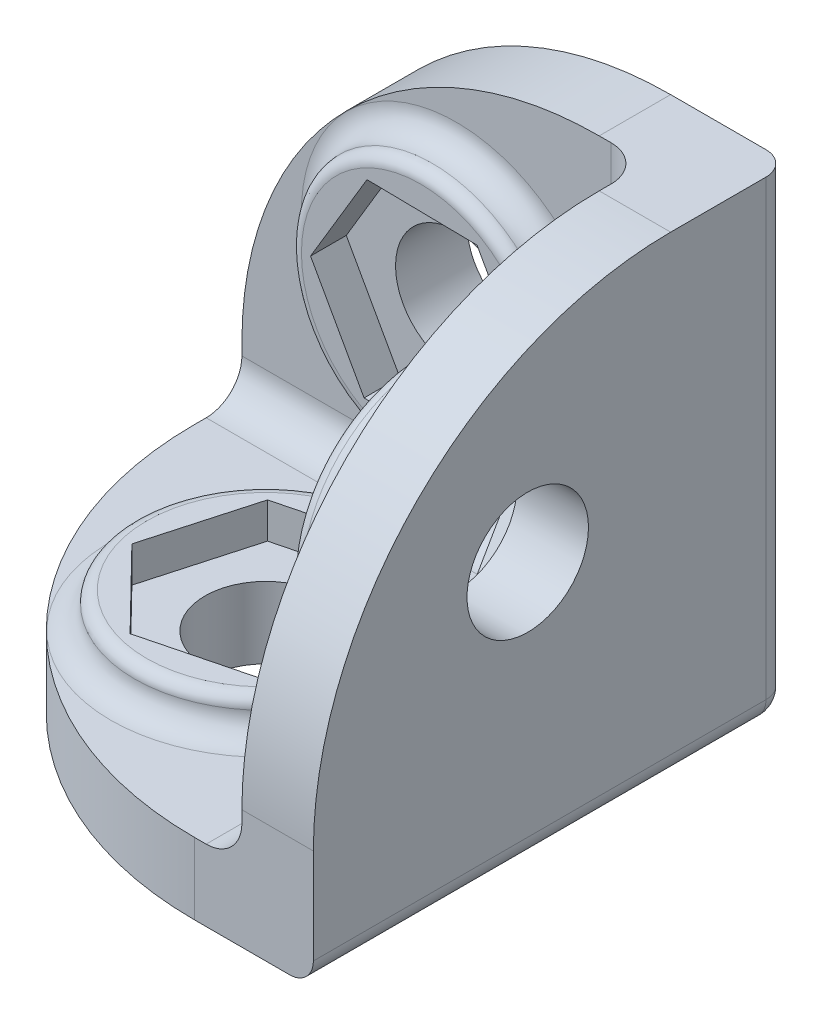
ISO-10303-21;
HEADER;
FILE_DESCRIPTION(('STEP AP214'),'2;1');
FILE_NAME('part.step','',(''),(''),'','','');
FILE_SCHEMA(('AUTOMOTIVE_DESIGN { 1 0 10303 214 1 1 1 1 }'));
ENDSEC;
DATA;
#1=APPLICATION_CONTEXT('core data for automotive mechanical design processes');
#2=APPLICATION_PROTOCOL_DEFINITION('international standard','automotive_design',2000,#1);
#3=PRODUCT_CONTEXT('',#1,'mechanical');
#4=PRODUCT('Part','Part','',(#3));
#5=PRODUCT_RELATED_PRODUCT_CATEGORY('part','',(#4));
#6=PRODUCT_DEFINITION_FORMATION('','',#4);
#7=PRODUCT_DEFINITION_CONTEXT('part definition',#1,'design');
#8=PRODUCT_DEFINITION('design','',#6,#7);
#9=PRODUCT_DEFINITION_SHAPE('','',#8);
#10=(LENGTH_UNIT() NAMED_UNIT(*) SI_UNIT(.MILLI.,.METRE.));
#11=(NAMED_UNIT(*) PLANE_ANGLE_UNIT() SI_UNIT($,.RADIAN.));
#12=(NAMED_UNIT(*) SI_UNIT($,.STERADIAN.) SOLID_ANGLE_UNIT());
#13=UNCERTAINTY_MEASURE_WITH_UNIT(LENGTH_MEASURE(1.E-05),#10,'distance_accuracy_value','');
#14=(GEOMETRIC_REPRESENTATION_CONTEXT(3) GLOBAL_UNCERTAINTY_ASSIGNED_CONTEXT((#13)) GLOBAL_UNIT_ASSIGNED_CONTEXT((#10,
#11,#12)) REPRESENTATION_CONTEXT('',''));
#15=CARTESIAN_POINT('',(0.,0.,0.));
#16=DIRECTION('',(0.,0.,1.));
#17=DIRECTION('',(1.,0.,0.));
#18=AXIS2_PLACEMENT_3D('',#15,#16,#17);
#19=CARTESIAN_POINT('',(0.,0.,-4.83720930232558));
#20=DIRECTION('',(0.,0.,-1.));
#21=DIRECTION('',(-1.,0.,0.));
#22=AXIS2_PLACEMENT_3D('',#19,#20,#21);
#23=PLANE('',#22);
#24=DIRECTION('',(0.,-1.,0.));
#25=VECTOR('',#24,1.);
#26=CARTESIAN_POINT('',(2.73280034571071,20.,-4.83720930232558));
#27=LINE('',#26,#25);
#28=CARTESIAN_POINT('',(2.73280034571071,4.5,-4.83720930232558));
#29=VERTEX_POINT('',#28);
#30=CARTESIAN_POINT('',(2.73280034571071,11.,-4.83720930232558));
#31=VERTEX_POINT('',#30);
#32=EDGE_CURVE('E477',#29,#31,#27,.F.);
#33=ORIENTED_EDGE('',*,*,#32,.T.);
#34=CARTESIAN_POINT('',(-3.76719965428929,11.,-4.83720930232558));
#35=DIRECTION('',(0.,0.,-1.));
#36=DIRECTION('',(-1.,0.,0.));
#37=AXIS2_PLACEMENT_3D('',#34,#35,#36);
#38=CIRCLE('',#37,6.5);
#39=CARTESIAN_POINT('',(-3.76719965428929,4.5,-4.83720930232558));
#40=VERTEX_POINT('',#39);
#41=EDGE_CURVE('E11',#31,#40,#38,.T.);
#42=ORIENTED_EDGE('',*,*,#41,.T.);
#43=DIRECTION('',(1.,0.,0.));
#44=VECTOR('',#43,1.);
#45=CARTESIAN_POINT('',(0.,4.5,-4.83720930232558));
#46=LINE('',#45,#44);
#47=EDGE_CURVE('E665',#40,#29,#46,.T.);
#48=ORIENTED_EDGE('',*,*,#47,.T.);
#49=EDGE_LOOP('',(#33,#42,#48));
#50=FACE_BOUND('',#49,.T.);
#51=ADVANCED_FACE('F35',(#50),#23,.F.);
#52=CARTESIAN_POINT('',(4.23280034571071,0.,0.));
#53=DIRECTION('',(1.,0.,0.));
#54=DIRECTION('',(0.,0.,-1.));
#55=AXIS2_PLACEMENT_3D('',#52,#53,#54);
#56=PLANE('',#55);
#57=DIRECTION('',(0.,-1.,0.));
#58=VECTOR('',#57,1.);
#59=CARTESIAN_POINT('',(4.23280034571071,3.,-3.33720930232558));
#60=LINE('',#59,#58);
#61=CARTESIAN_POINT('',(4.23280034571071,20.,-3.33720930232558));
#62=VERTEX_POINT('',#61);
#63=CARTESIAN_POINT('',(4.23280034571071,11.,-3.33720930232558));
#64=VERTEX_POINT('',#63);
#65=EDGE_CURVE('E667',#62,#64,#60,.T.);
#66=ORIENTED_EDGE('',*,*,#65,.T.);
#67=CARTESIAN_POINT('',(4.23280034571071,11.,3.16279069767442));
#68=DIRECTION('',(1.,0.,0.));
#69=DIRECTION('',(0.,0.,-1.));
#70=AXIS2_PLACEMENT_3D('',#67,#68,#69);
#71=CIRCLE('',#70,6.5);
#72=CARTESIAN_POINT('',(4.23280034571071,4.5,3.16279069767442));
#73=VERTEX_POINT('',#72);
#74=EDGE_CURVE('E544',#64,#73,#71,.T.);
#75=ORIENTED_EDGE('',*,*,#74,.T.);
#76=DIRECTION('',(0.,0.,1.));
#77=VECTOR('',#76,1.);
#78=CARTESIAN_POINT('',(4.23280034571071,4.5,0.));
#79=LINE('',#78,#77);
#80=CARTESIAN_POINT('',(4.23280034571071,4.5,12.1627906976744));
#81=VERTEX_POINT('',#80);
#82=EDGE_CURVE('E679',#73,#81,#79,.T.);
#83=ORIENTED_EDGE('',*,*,#82,.T.);
#84=DIRECTION('',(0.,1.,0.));
#85=VECTOR('',#84,1.);
#86=CARTESIAN_POINT('',(4.23280034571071,0.,12.1627906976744));
#87=LINE('',#86,#85);
#88=CARTESIAN_POINT('',(4.23280034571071,5.,12.1627906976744));
#89=VERTEX_POINT('',#88);
#90=EDGE_CURVE('E415',#81,#89,#87,.T.);
#91=ORIENTED_EDGE('',*,*,#90,.T.);
#92=CARTESIAN_POINT('',(4.23280034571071,4.99999999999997,-2.83720930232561));
#93=DIRECTION('',(1.,0.,0.));
#94=DIRECTION('',(0.,0.,-1.));
#95=AXIS2_PLACEMENT_3D('',#92,#93,#94);
#96=CIRCLE('',#95,15.);
#97=CARTESIAN_POINT('',(4.23280034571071,20.,-2.83720930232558));
#98=VERTEX_POINT('',#97);
#99=EDGE_CURVE('E412',#89,#98,#96,.F.);
#100=ORIENTED_EDGE('',*,*,#99,.T.);
#101=DIRECTION('',(0.,0.,1.));
#102=VECTOR('',#101,1.);
#103=CARTESIAN_POINT('',(4.23280034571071,20.,0.));
#104=LINE('',#103,#102);
#105=EDGE_CURVE('E418',#62,#98,#104,.T.);
#106=ORIENTED_EDGE('',*,*,#105,.F.);
#107=EDGE_LOOP('',(#66,#75,#83,#91,#100,#106));
#108=FACE_BOUND('',#107,.T.);
#109=ADVANCED_FACE('F606',(#108),#56,.F.);
#110=CARTESIAN_POINT('',(4.23280034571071,4.5,-3.33720930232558));
#111=VERTEX_POINT('',#110);
#112=EDGE_CURVE('E676',#111,#73,#79,.T.);
#113=ORIENTED_EDGE('',*,*,#112,.T.);
#114=CARTESIAN_POINT('',(4.23280034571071,11.,3.16279069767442));
#115=DIRECTION('',(1.,0.,0.));
#116=DIRECTION('',(0.,0.,-1.));
#117=AXIS2_PLACEMENT_3D('',#114,#115,#116);
#118=CIRCLE('',#117,6.5);
#119=EDGE_CURVE('E542',#73,#64,#118,.T.);
#120=ORIENTED_EDGE('',*,*,#119,.T.);
#121=EDGE_CURVE('E678',#64,#111,#60,.T.);
#122=ORIENTED_EDGE('',*,*,#121,.T.);
#123=EDGE_LOOP('',(#113,#120,#122));
#124=FACE_BOUND('',#123,.T.);
#125=ADVANCED_FACE('F613',(#124),#56,.F.);
#126=CARTESIAN_POINT('',(-12.7671996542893,4.5,-4.83720930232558));
#127=VERTEX_POINT('',#126);
#128=EDGE_CURVE('E663',#127,#40,#46,.T.);
#129=ORIENTED_EDGE('',*,*,#128,.T.);
#130=CARTESIAN_POINT('',(-3.76719965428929,11.,-4.83720930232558));
#131=DIRECTION('',(0.,0.,-1.));
#132=DIRECTION('',(-1.,0.,0.));
#133=AXIS2_PLACEMENT_3D('',#130,#131,#132);
#134=CIRCLE('',#133,6.5);
#135=EDGE_CURVE('E43',#40,#31,#134,.T.);
#136=ORIENTED_EDGE('',*,*,#135,.T.);
#137=CARTESIAN_POINT('',(2.73280034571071,20.,-4.83720930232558));
#138=VERTEX_POINT('',#137);
#139=EDGE_CURVE('E661',#31,#138,#27,.F.);
#140=ORIENTED_EDGE('',*,*,#139,.T.);
#141=DIRECTION('',(-1.,0.,0.));
#142=VECTOR('',#141,1.);
#143=CARTESIAN_POINT('',(0.,20.,-4.83720930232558));
#144=LINE('',#143,#142);
#145=CARTESIAN_POINT('',(2.23280034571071,20.,-4.83720930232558));
#146=VERTEX_POINT('',#145);
#147=EDGE_CURVE('E439',#138,#146,#144,.T.);
#148=ORIENTED_EDGE('',*,*,#147,.T.);
#149=CARTESIAN_POINT('',(2.23280034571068,5.00000000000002,-4.83720930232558));
#150=DIRECTION('',(0.,0.,-1.));
#151=DIRECTION('',(-1.,0.,0.));
#152=AXIS2_PLACEMENT_3D('',#149,#150,#151);
#153=CIRCLE('',#152,15.);
#154=CARTESIAN_POINT('',(-12.7671996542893,5.,-4.83720930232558));
#155=VERTEX_POINT('',#154);
#156=EDGE_CURVE('E436',#146,#155,#153,.F.);
#157=ORIENTED_EDGE('',*,*,#156,.T.);
#158=DIRECTION('',(0.,1.,0.));
#159=VECTOR('',#158,1.);
#160=CARTESIAN_POINT('',(-12.7671996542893,0.,-4.83720930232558));
#161=LINE('',#160,#159);
#162=EDGE_CURVE('E442',#127,#155,#161,.T.);
#163=ORIENTED_EDGE('',*,*,#162,.F.);
#164=EDGE_LOOP('',(#129,#136,#140,#148,#157,#163));
#165=FACE_BOUND('',#164,.T.);
#166=ADVANCED_FACE('F609',(#165),#23,.F.);
#167=CARTESIAN_POINT('',(2.23280034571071,3.,-2.83720930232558));
#168=DIRECTION('',(0.,1.,0.));
#169=DIRECTION('',(0.,0.,1.));
#170=AXIS2_PLACEMENT_3D('',#167,#168,#169);
#171=PLANE('',#170);
#172=DIRECTION('',(1.,0.,0.));
#173=VECTOR('',#172,1.);
#174=CARTESIAN_POINT('',(2.23280034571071,3.,-3.33720930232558));
#175=LINE('',#174,#173);
#176=CARTESIAN_POINT('',(2.73280034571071,3.,-3.33720930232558));
#177=VERTEX_POINT('',#176);
#178=CARTESIAN_POINT('',(-3.76719965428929,3.,-3.33720930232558));
#179=VERTEX_POINT('',#178);
#180=EDGE_CURVE('E479',#177,#179,#175,.F.);
#181=ORIENTED_EDGE('',*,*,#180,.T.);
#182=CARTESIAN_POINT('',(-3.76719965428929,3.,3.16279069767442));
#183=DIRECTION('',(0.,1.,0.));
#184=DIRECTION('',(0.,0.,1.));
#185=AXIS2_PLACEMENT_3D('',#182,#183,#184);
#186=CIRCLE('',#185,6.5);
#187=CARTESIAN_POINT('',(2.73280034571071,3.,3.16279069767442));
#188=VERTEX_POINT('',#187);
#189=EDGE_CURVE('E505',#179,#188,#186,.F.);
#190=ORIENTED_EDGE('',*,*,#189,.T.);
#191=DIRECTION('',(0.,0.,1.));
#192=VECTOR('',#191,1.);
#193=CARTESIAN_POINT('',(2.73280034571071,3.,-2.83720930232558));
#194=LINE('',#193,#192);
#195=EDGE_CURVE('E482',#188,#177,#194,.F.);
#196=ORIENTED_EDGE('',*,*,#195,.T.);
#197=EDGE_LOOP('',(#181,#190,#196));
#198=FACE_BOUND('',#197,.T.);
#199=ADVANCED_FACE('F621',(#198),#171,.T.);
#200=CARTESIAN_POINT('',(2.73280034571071,3.,12.1627906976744));
#201=VERTEX_POINT('',#200);
#202=EDGE_CURVE('E484',#201,#188,#194,.F.);
#203=ORIENTED_EDGE('',*,*,#202,.T.);
#204=CARTESIAN_POINT('',(-3.76719965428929,3.,3.16279069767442));
#205=DIRECTION('',(0.,1.,0.));
#206=DIRECTION('',(0.,0.,1.));
#207=AXIS2_PLACEMENT_3D('',#204,#205,#206);
#208=CIRCLE('',#207,6.5);
#209=EDGE_CURVE('E503',#188,#179,#208,.F.);
#210=ORIENTED_EDGE('',*,*,#209,.T.);
#211=CARTESIAN_POINT('',(-12.7671996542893,3.,-3.33720930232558));
#212=VERTEX_POINT('',#211);
#213=EDGE_CURVE('E483',#179,#212,#175,.F.);
#214=ORIENTED_EDGE('',*,*,#213,.T.);
#215=DIRECTION('',(0.,0.,1.));
#216=VECTOR('',#215,1.);
#217=CARTESIAN_POINT('',(-12.7671996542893,3.,-2.83720930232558));
#218=LINE('',#217,#216);
#219=CARTESIAN_POINT('',(-12.7671996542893,3.,-2.83720930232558));
#220=VERTEX_POINT('',#219);
#221=EDGE_CURVE('E473',#212,#220,#218,.T.);
#222=ORIENTED_EDGE('',*,*,#221,.T.);
#223=CARTESIAN_POINT('',(2.23280034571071,3.,-2.83720930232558));
#224=DIRECTION('',(0.,1.,0.));
#225=DIRECTION('',(0.,0.,1.));
#226=AXIS2_PLACEMENT_3D('',#223,#224,#225);
#227=CIRCLE('',#226,15.);
#228=CARTESIAN_POINT('',(2.23280034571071,3.,12.1627906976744));
#229=VERTEX_POINT('',#228);
#230=EDGE_CURVE('E470',#220,#229,#227,.T.);
#231=ORIENTED_EDGE('',*,*,#230,.T.);
#232=DIRECTION('',(1.,0.,0.));
#233=VECTOR('',#232,1.);
#234=CARTESIAN_POINT('',(7.23280034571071,3.,12.1627906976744));
#235=LINE('',#234,#233);
#236=EDGE_CURVE('E700',#229,#201,#235,.T.);
#237=ORIENTED_EDGE('',*,*,#236,.T.);
#238=EDGE_LOOP('',(#203,#210,#214,#222,#231,#237));
#239=FACE_BOUND('',#238,.T.);
#240=ADVANCED_FACE('F632',(#239),#171,.T.);
#241=DIRECTION('',(-0.968839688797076,0.,0.247688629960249));
#242=VECTOR('',#241,1.);
#243=CARTESIAN_POINT('',(-2.52051475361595,3.,-1.28458044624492));
#244=LINE('',#243,#242);
#245=CARTESIAN_POINT('',(-2.52051475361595,3.,-1.28458044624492));
#246=VERTEX_POINT('',#245);
#247=CARTESIAN_POINT('',(-6.99539359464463,3.,-0.140555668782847));
#248=VERTEX_POINT('',#247);
#249=EDGE_CURVE('E382',#246,#248,#244,.T.);
#250=ORIENTED_EDGE('',*,*,#249,.T.);
#251=DIRECTION('',(-0.269915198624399,0.,0.962884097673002));
#252=VECTOR('',#251,1.);
#253=CARTESIAN_POINT('',(-6.99539359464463,3.,-0.140555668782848));
#254=LINE('',#253,#252);
#255=CARTESIAN_POINT('',(-8.24207849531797,3.,4.30681547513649));
#256=VERTEX_POINT('',#255);
#257=EDGE_CURVE('E384',#248,#256,#254,.T.);
#258=ORIENTED_EDGE('',*,*,#257,.T.);
#259=DIRECTION('',(0.698924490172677,0.,0.715195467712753));
#260=VECTOR('',#259,1.);
#261=CARTESIAN_POINT('',(-8.24207849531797,3.,4.30681547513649));
#262=LINE('',#261,#260);
#263=CARTESIAN_POINT('',(-5.01388455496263,3.,7.61016184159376));
#264=VERTEX_POINT('',#263);
#265=EDGE_CURVE('E387',#256,#264,#262,.T.);
#266=ORIENTED_EDGE('',*,*,#265,.T.);
#267=DIRECTION('',(0.968839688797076,0.,-0.247688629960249));
#268=VECTOR('',#267,1.);
#269=CARTESIAN_POINT('',(-5.01388455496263,3.,7.61016184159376));
#270=LINE('',#269,#268);
#271=CARTESIAN_POINT('',(-0.539005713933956,3.,6.46613706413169));
#272=VERTEX_POINT('',#271);
#273=EDGE_CURVE('E389',#264,#272,#270,.T.);
#274=ORIENTED_EDGE('',*,*,#273,.T.);
#275=DIRECTION('',(0.269915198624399,0.,-0.962884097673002));
#276=VECTOR('',#275,1.);
#277=CARTESIAN_POINT('',(-0.539005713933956,3.,6.46613706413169));
#278=LINE('',#277,#276);
#279=CARTESIAN_POINT('',(0.70767918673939,3.,2.01876592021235));
#280=VERTEX_POINT('',#279);
#281=EDGE_CURVE('E391',#272,#280,#278,.T.);
#282=ORIENTED_EDGE('',*,*,#281,.T.);
#283=DIRECTION('',(-0.698924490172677,0.,-0.715195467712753));
#284=VECTOR('',#283,1.);
#285=CARTESIAN_POINT('',(0.70767918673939,3.,2.01876592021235));
#286=LINE('',#285,#284);
#287=EDGE_CURVE('E370',#280,#246,#286,.T.);
#288=ORIENTED_EDGE('',*,*,#287,.T.);
#289=EDGE_LOOP('',(#250,#258,#266,#274,#282,#288));
#290=FACE_BOUND('',#289,.T.);
#291=CARTESIAN_POINT('',(-3.76719965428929,3.,3.16279069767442));
#292=DIRECTION('',(0.,1.,0.));
#293=DIRECTION('',(0.,0.,1.));
#294=AXIS2_PLACEMENT_3D('',#291,#292,#293);
#295=CIRCLE('',#294,2.55);
#296=CARTESIAN_POINT('',(-3.76719965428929,3.,5.71279069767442));
#297=VERTEX_POINT('',#296);
#298=EDGE_CURVE('E462',#297,#297,#295,.T.);
#299=ORIENTED_EDGE('',*,*,#298,.F.);
#300=EDGE_LOOP('',(#299));
#301=FACE_BOUND('',#300,.T.);
#302=ADVANCED_FACE('F624',(#290,#301),#171,.T.);
#303=DIRECTION('',(0.486657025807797,-0.873593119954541,0.));
#304=VECTOR('',#303,1.);
#305=CARTESIAN_POINT('',(-8.38545839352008,11.0708487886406,-4.83720930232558));
#306=LINE('',#305,#304);
#307=CARTESIAN_POINT('',(-8.38545839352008,11.0708487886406,-4.83720930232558));
#308=VERTEX_POINT('',#307);
#309=CARTESIAN_POINT('',(-6.13768587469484,7.03589500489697,-4.83720930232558));
#310=VERTEX_POINT('',#309);
#311=EDGE_CURVE('E326',#308,#310,#306,.T.);
#312=ORIENTED_EDGE('',*,*,#311,.T.);
#313=DIRECTION('',(0.999882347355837,-0.0153392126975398,0.));
#314=VECTOR('',#313,1.);
#315=CARTESIAN_POINT('',(-6.13768587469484,7.03589500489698,-4.83720930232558));
#316=LINE('',#315,#314);
#317=CARTESIAN_POINT('',(-1.51942713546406,6.96504621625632,-4.83720930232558));
#318=VERTEX_POINT('',#317);
#319=EDGE_CURVE('E284',#310,#318,#316,.T.);
#320=ORIENTED_EDGE('',*,*,#319,.T.);
#321=DIRECTION('',(0.513225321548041,0.858253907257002,0.));
#322=VECTOR('',#321,1.);
#323=CARTESIAN_POINT('',(-1.51942713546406,6.96504621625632,-4.83720930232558));
#324=LINE('',#323,#322);
#325=CARTESIAN_POINT('',(0.851059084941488,10.9291512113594,-4.83720930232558));
#326=VERTEX_POINT('',#325);
#327=EDGE_CURVE('E340',#318,#326,#324,.T.);
#328=ORIENTED_EDGE('',*,*,#327,.T.);
#329=DIRECTION('',(-0.486657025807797,0.873593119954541,0.));
#330=VECTOR('',#329,1.);
#331=CARTESIAN_POINT('',(0.851059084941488,10.9291512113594,-4.83720930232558));
#332=LINE('',#331,#330);
#333=CARTESIAN_POINT('',(-1.39671343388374,14.964104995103,-4.83720930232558));
#334=VERTEX_POINT('',#333);
#335=EDGE_CURVE('E343',#326,#334,#332,.T.);
#336=ORIENTED_EDGE('',*,*,#335,.T.);
#337=DIRECTION('',(-0.999882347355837,0.0153392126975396,0.));
#338=VECTOR('',#337,1.);
#339=CARTESIAN_POINT('',(-1.39671343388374,14.964104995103,-4.83720930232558));
#340=LINE('',#339,#338);
#341=CARTESIAN_POINT('',(-6.01497217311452,15.0349537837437,-4.83720930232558));
#342=VERTEX_POINT('',#341);
#343=EDGE_CURVE('E346',#334,#342,#340,.T.);
#344=ORIENTED_EDGE('',*,*,#343,.T.);
#345=DIRECTION('',(-0.513225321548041,-0.858253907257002,0.));
#346=VECTOR('',#345,1.);
#347=CARTESIAN_POINT('',(-6.01497217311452,15.0349537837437,-4.83720930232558));
#348=LINE('',#347,#346);
#349=EDGE_CURVE('E349',#342,#308,#348,.T.);
#350=ORIENTED_EDGE('',*,*,#349,.T.);
#351=EDGE_LOOP('',(#312,#320,#328,#336,#344,#350));
#352=FACE_BOUND('',#351,.T.);
#353=CARTESIAN_POINT('',(-3.76719965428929,11.,-4.83720930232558));
#354=DIRECTION('',(0.,0.,-1.));
#355=DIRECTION('',(-1.,0.,0.));
#356=AXIS2_PLACEMENT_3D('',#353,#354,#355);
#357=CIRCLE('',#356,2.55);
#358=CARTESIAN_POINT('',(-6.31719965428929,11.,-4.83720930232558));
#359=VERTEX_POINT('',#358);
#360=EDGE_CURVE('E443',#359,#359,#357,.T.);
#361=ORIENTED_EDGE('',*,*,#360,.T.);
#362=EDGE_LOOP('',(#361));
#363=FACE_BOUND('',#362,.T.);
#364=ADVANCED_FACE('F582',(#352,#363),#23,.F.);
#365=CARTESIAN_POINT('',(2.23280034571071,0.,-2.83720930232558));
#366=DIRECTION('',(0.,1.,0.));
#367=DIRECTION('',(0.,0.,1.));
#368=AXIS2_PLACEMENT_3D('',#365,#366,#367);
#369=PLANE('',#368);
#370=DIRECTION('',(-1.,0.,0.));
#371=VECTOR('',#370,1.);
#372=CARTESIAN_POINT('',(2.23280034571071,0.,-6.83720930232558));
#373=LINE('',#372,#371);
#374=CARTESIAN_POINT('',(-12.7671996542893,0.,-6.83720930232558));
#375=VERTEX_POINT('',#374);
#376=CARTESIAN_POINT('',(6.23280034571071,0.,-6.83720930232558));
#377=VERTEX_POINT('',#376);
#378=EDGE_CURVE('E513',#375,#377,#373,.F.);
#379=ORIENTED_EDGE('',*,*,#378,.T.);
#380=DIRECTION('',(0.,0.,-1.));
#381=VECTOR('',#380,1.);
#382=CARTESIAN_POINT('',(6.23280034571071,0.,-2.83720930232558));
#383=LINE('',#382,#381);
#384=CARTESIAN_POINT('',(6.23280034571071,0.,12.1627906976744));
#385=VERTEX_POINT('',#384);
#386=EDGE_CURVE('E515',#377,#385,#383,.F.);
#387=ORIENTED_EDGE('',*,*,#386,.T.);
#388=DIRECTION('',(1.,0.,0.));
#389=VECTOR('',#388,1.);
#390=CARTESIAN_POINT('',(7.23280034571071,0.,12.1627906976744));
#391=LINE('',#390,#389);
#392=CARTESIAN_POINT('',(2.23280034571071,0.,12.1627906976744));
#393=VERTEX_POINT('',#392);
#394=EDGE_CURVE('E476',#393,#385,#391,.T.);
#395=ORIENTED_EDGE('',*,*,#394,.F.);
#396=CARTESIAN_POINT('',(2.23280034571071,0.,-2.83720930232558));
#397=DIRECTION('',(0.,1.,0.));
#398=DIRECTION('',(0.,0.,1.));
#399=AXIS2_PLACEMENT_3D('',#396,#397,#398);
#400=CIRCLE('',#399,15.);
#401=CARTESIAN_POINT('',(-12.7671996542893,0.,-2.83720930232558));
#402=VERTEX_POINT('',#401);
#403=EDGE_CURVE('E703',#402,#393,#400,.T.);
#404=ORIENTED_EDGE('',*,*,#403,.F.);
#405=DIRECTION('',(0.,0.,1.));
#406=VECTOR('',#405,1.);
#407=CARTESIAN_POINT('',(-12.7671996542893,0.,-2.83720930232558));
#408=LINE('',#407,#406);
#409=EDGE_CURVE('E465',#375,#402,#408,.T.);
#410=ORIENTED_EDGE('',*,*,#409,.F.);
#411=EDGE_LOOP('',(#379,#387,#395,#404,#410));
#412=FACE_BOUND('',#411,.T.);
#413=CARTESIAN_POINT('',(-3.76719965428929,0.,3.16279069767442));
#414=DIRECTION('',(0.,1.,0.));
#415=DIRECTION('',(0.,0.,1.));
#416=AXIS2_PLACEMENT_3D('',#413,#414,#415);
#417=CIRCLE('',#416,2.55);
#418=CARTESIAN_POINT('',(-3.76719965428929,0.,5.71279069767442));
#419=VERTEX_POINT('',#418);
#420=EDGE_CURVE('E456',#419,#419,#417,.T.);
#421=ORIENTED_EDGE('',*,*,#420,.T.);
#422=EDGE_LOOP('',(#421));
#423=FACE_BOUND('',#422,.T.);
#424=ADVANCED_FACE('F623',(#412,#423),#369,.F.);
#425=CARTESIAN_POINT('',(7.23280034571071,3.,-7.83720930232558));
#426=DIRECTION('',(-1.,0.,0.));
#427=DIRECTION('',(0.,0.,1.));
#428=AXIS2_PLACEMENT_3D('',#425,#426,#427);
#429=PLANE('',#428);
#430=DIRECTION('',(0.,-1.,0.));
#431=VECTOR('',#430,1.);
#432=CARTESIAN_POINT('',(7.23280034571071,3.,12.1627906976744));
#433=LINE('',#432,#431);
#434=CARTESIAN_POINT('',(7.23280034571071,5.,12.1627906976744));
#435=VERTEX_POINT('',#434);
#436=CARTESIAN_POINT('',(7.23280034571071,1.,12.1627906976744));
#437=VERTEX_POINT('',#436);
#438=EDGE_CURVE('E695',#435,#437,#433,.T.);
#439=ORIENTED_EDGE('',*,*,#438,.T.);
#440=DIRECTION('',(0.,0.,-1.));
#441=VECTOR('',#440,1.);
#442=CARTESIAN_POINT('',(7.23280034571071,1.,-7.83720930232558));
#443=LINE('',#442,#441);
#444=CARTESIAN_POINT('',(7.23280034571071,1.,-6.83720930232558));
#445=VERTEX_POINT('',#444);
#446=EDGE_CURVE('E510',#437,#445,#443,.T.);
#447=ORIENTED_EDGE('',*,*,#446,.T.);
#448=DIRECTION('',(0.,-1.,0.));
#449=VECTOR('',#448,1.);
#450=CARTESIAN_POINT('',(7.23280034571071,3.,-6.83720930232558));
#451=LINE('',#450,#449);
#452=CARTESIAN_POINT('',(7.23280034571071,20.,-6.83720930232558));
#453=VERTEX_POINT('',#452);
#454=EDGE_CURVE('E508',#445,#453,#451,.F.);
#455=ORIENTED_EDGE('',*,*,#454,.T.);
#456=DIRECTION('',(0.,0.,-1.));
#457=VECTOR('',#456,1.);
#458=CARTESIAN_POINT('',(7.23280034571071,20.,-4.83720930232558));
#459=LINE('',#458,#457);
#460=CARTESIAN_POINT('',(7.23280034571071,20.,-2.83720930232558));
#461=VERTEX_POINT('',#460);
#462=EDGE_CURVE('E457',#461,#453,#459,.T.);
#463=ORIENTED_EDGE('',*,*,#462,.F.);
#464=CARTESIAN_POINT('',(7.23280034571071,4.99999999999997,-2.83720930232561));
#465=DIRECTION('',(1.,0.,0.));
#466=DIRECTION('',(0.,0.,-1.));
#467=AXIS2_PLACEMENT_3D('',#464,#465,#466);
#468=CIRCLE('',#467,15.);
#469=EDGE_CURVE('E424',#435,#461,#468,.F.);
#470=ORIENTED_EDGE('',*,*,#469,.F.);
#471=EDGE_LOOP('',(#439,#447,#455,#463,#470));
#472=FACE_BOUND('',#471,.T.);
#473=CARTESIAN_POINT('',(7.23280034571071,11.,3.16279069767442));
#474=DIRECTION('',(1.,0.,0.));
#475=DIRECTION('',(0.,0.,-1.));
#476=AXIS2_PLACEMENT_3D('',#473,#474,#475);
#477=CIRCLE('',#476,2.55);
#478=CARTESIAN_POINT('',(7.23280034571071,11.,0.61279069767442));
#479=VERTEX_POINT('',#478);
#480=EDGE_CURVE('E416',#479,#479,#477,.T.);
#481=ORIENTED_EDGE('',*,*,#480,.F.);
#482=EDGE_LOOP('',(#481));
#483=FACE_BOUND('',#482,.T.);
#484=ADVANCED_FACE('F629',(#472,#483),#429,.F.);
#485=CARTESIAN_POINT('',(-12.7671996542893,3.,-7.83720930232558));
#486=DIRECTION('',(0.,0.,1.));
#487=DIRECTION('',(1.,0.,0.));
#488=AXIS2_PLACEMENT_3D('',#485,#486,#487);
#489=PLANE('',#488);
#490=DIRECTION('',(-1.,0.,0.));
#491=VECTOR('',#490,1.);
#492=CARTESIAN_POINT('',(0.,20.,-7.83720930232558));
#493=LINE('',#492,#491);
#494=CARTESIAN_POINT('',(6.23280034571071,20.,-7.83720930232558));
#495=VERTEX_POINT('',#494);
#496=CARTESIAN_POINT('',(2.23280034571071,20.,-7.83720930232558));
#497=VERTEX_POINT('',#496);
#498=EDGE_CURVE('E449',#495,#497,#493,.T.);
#499=ORIENTED_EDGE('',*,*,#498,.F.);
#500=DIRECTION('',(0.,-1.,0.));
#501=VECTOR('',#500,1.);
#502=CARTESIAN_POINT('',(6.23280034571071,3.,-7.83720930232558));
#503=LINE('',#502,#501);
#504=CARTESIAN_POINT('',(6.23280034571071,1.,-7.83720930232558));
#505=VERTEX_POINT('',#504);
#506=EDGE_CURVE('E521',#495,#505,#503,.T.);
#507=ORIENTED_EDGE('',*,*,#506,.T.);
#508=DIRECTION('',(-1.,0.,0.));
#509=VECTOR('',#508,1.);
#510=CARTESIAN_POINT('',(-12.7671996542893,1.,-7.83720930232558));
#511=LINE('',#510,#509);
#512=CARTESIAN_POINT('',(-12.7671996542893,1.,-7.83720930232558));
#513=VERTEX_POINT('',#512);
#514=EDGE_CURVE('E519',#505,#513,#511,.T.);
#515=ORIENTED_EDGE('',*,*,#514,.T.);
#516=DIRECTION('',(0.,-1.,0.));
#517=VECTOR('',#516,1.);
#518=CARTESIAN_POINT('',(-12.7671996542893,3.,-7.83720930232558));
#519=LINE('',#518,#517);
#520=CARTESIAN_POINT('',(-12.7671996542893,5.,-7.83720930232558));
#521=VERTEX_POINT('',#520);
#522=EDGE_CURVE('E674',#521,#513,#519,.T.);
#523=ORIENTED_EDGE('',*,*,#522,.F.);
#524=CARTESIAN_POINT('',(2.23280034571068,5.00000000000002,-7.83720930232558));
#525=DIRECTION('',(0.,0.,-1.));
#526=DIRECTION('',(-1.,0.,0.));
#527=AXIS2_PLACEMENT_3D('',#524,#525,#526);
#528=CIRCLE('',#527,15.);
#529=EDGE_CURVE('E433',#497,#521,#528,.F.);
#530=ORIENTED_EDGE('',*,*,#529,.F.);
#531=EDGE_LOOP('',(#499,#507,#515,#523,#530));
#532=FACE_BOUND('',#531,.T.);
#533=CARTESIAN_POINT('',(-3.76719965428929,11.,-7.83720930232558));
#534=DIRECTION('',(0.,0.,-1.));
#535=DIRECTION('',(-1.,0.,0.));
#536=AXIS2_PLACEMENT_3D('',#533,#534,#535);
#537=CIRCLE('',#536,2.55);
#538=CARTESIAN_POINT('',(-6.31719965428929,11.,-7.83720930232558));
#539=VERTEX_POINT('',#538);
#540=EDGE_CURVE('E440',#539,#539,#537,.T.);
#541=ORIENTED_EDGE('',*,*,#540,.F.);
#542=EDGE_LOOP('',(#541));
#543=FACE_BOUND('',#542,.T.);
#544=ADVANCED_FACE('F745',(#532,#543),#489,.F.);
#545=CARTESIAN_POINT('',(-12.7671996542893,3.,-2.83720930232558));
#546=DIRECTION('',(1.,0.,0.));
#547=DIRECTION('',(0.,0.,-1.));
#548=AXIS2_PLACEMENT_3D('',#545,#546,#547);
#549=PLANE('',#548);
#550=ORIENTED_EDGE('',*,*,#522,.T.);
#551=CARTESIAN_POINT('',(-12.7671996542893,1.,-6.83720930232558));
#552=DIRECTION('',(1.,0.,0.));
#553=DIRECTION('',(0.,0.,-1.));
#554=AXIS2_PLACEMENT_3D('',#551,#552,#553);
#555=CIRCLE('',#554,1.);
#556=EDGE_CURVE('E525',#513,#375,#555,.F.);
#557=ORIENTED_EDGE('',*,*,#556,.T.);
#558=ORIENTED_EDGE('',*,*,#409,.T.);
#559=DIRECTION('',(0.,-1.,0.));
#560=VECTOR('',#559,1.);
#561=CARTESIAN_POINT('',(-12.7671996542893,3.,-2.83720930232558));
#562=LINE('',#561,#560);
#563=EDGE_CURVE('E685',#220,#402,#562,.T.);
#564=ORIENTED_EDGE('',*,*,#563,.F.);
#565=ORIENTED_EDGE('',*,*,#221,.F.);
#566=CARTESIAN_POINT('',(-12.7671996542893,4.5,-3.33720930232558));
#567=DIRECTION('',(1.,0.,0.));
#568=DIRECTION('',(0.,0.,-1.));
#569=AXIS2_PLACEMENT_3D('',#566,#567,#568);
#570=CIRCLE('',#569,1.5);
#571=EDGE_CURVE('E491',#212,#127,#570,.T.);
#572=ORIENTED_EDGE('',*,*,#571,.T.);
#573=ORIENTED_EDGE('',*,*,#162,.T.);
#574=DIRECTION('',(0.,0.,-1.));
#575=VECTOR('',#574,1.);
#576=CARTESIAN_POINT('',(-12.7671996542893,5.,-4.83720930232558));
#577=LINE('',#576,#575);
#578=EDGE_CURVE('E453',#155,#521,#577,.T.);
#579=ORIENTED_EDGE('',*,*,#578,.T.);
#580=EDGE_LOOP('',(#550,#557,#558,#564,#565,#572,#573,#579));
#581=FACE_BOUND('',#580,.T.);
#582=ADVANCED_FACE('F754',(#581),#549,.F.);
#583=CARTESIAN_POINT('',(2.23280034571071,3.,-2.83720930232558));
#584=DIRECTION('',(0.,-1.,0.));
#585=DIRECTION('',(0.,0.,-1.));
#586=AXIS2_PLACEMENT_3D('',#583,#584,#585);
#587=CYLINDRICAL_SURFACE('',#586,15.);
#588=ORIENTED_EDGE('',*,*,#403,.T.);
#589=DIRECTION('',(0.,-1.,0.));
#590=VECTOR('',#589,1.);
#591=CARTESIAN_POINT('',(2.23280034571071,3.,12.1627906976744));
#592=LINE('',#591,#590);
#593=EDGE_CURVE('E689',#229,#393,#592,.T.);
#594=ORIENTED_EDGE('',*,*,#593,.F.);
#595=ORIENTED_EDGE('',*,*,#230,.F.);
#596=ORIENTED_EDGE('',*,*,#563,.T.);
#597=EDGE_LOOP('',(#588,#594,#595,#596));
#598=FACE_BOUND('',#597,.T.);
#599=ADVANCED_FACE('F707',(#598),#587,.T.);
#600=CARTESIAN_POINT('',(7.23280034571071,3.,12.1627906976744));
#601=DIRECTION('',(0.,0.,-1.));
#602=DIRECTION('',(-1.,0.,0.));
#603=AXIS2_PLACEMENT_3D('',#600,#601,#602);
#604=PLANE('',#603);
#605=ORIENTED_EDGE('',*,*,#394,.T.);
#606=CARTESIAN_POINT('',(6.23280034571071,1.,12.1627906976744));
#607=DIRECTION('',(0.,0.,-1.));
#608=DIRECTION('',(-1.,0.,0.));
#609=AXIS2_PLACEMENT_3D('',#606,#607,#608);
#610=CIRCLE('',#609,1.);
#611=EDGE_CURVE('E517',#385,#437,#610,.F.);
#612=ORIENTED_EDGE('',*,*,#611,.T.);
#613=ORIENTED_EDGE('',*,*,#438,.F.);
#614=DIRECTION('',(1.,0.,0.));
#615=VECTOR('',#614,1.);
#616=CARTESIAN_POINT('',(4.23280034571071,5.,12.1627906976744));
#617=LINE('',#616,#615);
#618=EDGE_CURVE('E423',#89,#435,#617,.T.);
#619=ORIENTED_EDGE('',*,*,#618,.F.);
#620=ORIENTED_EDGE('',*,*,#90,.F.);
#621=CARTESIAN_POINT('',(2.73280034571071,4.5,12.1627906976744));
#622=DIRECTION('',(0.,0.,-1.));
#623=DIRECTION('',(-1.,0.,0.));
#624=AXIS2_PLACEMENT_3D('',#621,#622,#623);
#625=CIRCLE('',#624,1.5);
#626=EDGE_CURVE('E489',#81,#201,#625,.T.);
#627=ORIENTED_EDGE('',*,*,#626,.T.);
#628=ORIENTED_EDGE('',*,*,#236,.F.);
#629=ORIENTED_EDGE('',*,*,#593,.T.);
#630=EDGE_LOOP('',(#605,#612,#613,#619,#620,#627,#628,#629));
#631=FACE_BOUND('',#630,.T.);
#632=ADVANCED_FACE('F710',(#631),#604,.F.);
#633=CARTESIAN_POINT('',(-3.76719965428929,3.,3.16279069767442));
#634=DIRECTION('',(0.,-1.,0.));
#635=DIRECTION('',(0.,0.,-1.));
#636=AXIS2_PLACEMENT_3D('',#633,#634,#635);
#637=CYLINDRICAL_SURFACE('',#636,2.55);
#638=ORIENTED_EDGE('',*,*,#298,.T.);
#639=EDGE_LOOP('',(#638));
#640=FACE_BOUND('',#639,.T.);
#641=ORIENTED_EDGE('',*,*,#420,.F.);
#642=EDGE_LOOP('',(#641));
#643=FACE_BOUND('',#642,.T.);
#644=ADVANCED_FACE('F1112',(#640,#643),#637,.F.);
#645=CARTESIAN_POINT('',(2.23280034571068,5.00000000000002,-4.83720930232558));
#646=DIRECTION('',(0.,0.,-1.));
#647=DIRECTION('',(-1.,0.,0.));
#648=AXIS2_PLACEMENT_3D('',#645,#646,#647);
#649=CYLINDRICAL_SURFACE('',#648,15.);
#650=ORIENTED_EDGE('',*,*,#529,.T.);
#651=ORIENTED_EDGE('',*,*,#578,.F.);
#652=ORIENTED_EDGE('',*,*,#156,.F.);
#653=DIRECTION('',(0.,0.,-1.));
#654=VECTOR('',#653,1.);
#655=CARTESIAN_POINT('',(2.23280034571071,20.,-4.83720930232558));
#656=LINE('',#655,#654);
#657=EDGE_CURVE('E446',#146,#497,#656,.T.);
#658=ORIENTED_EDGE('',*,*,#657,.T.);
#659=EDGE_LOOP('',(#650,#651,#652,#658));
#660=FACE_BOUND('',#659,.T.);
#661=ADVANCED_FACE('F1123',(#660),#649,.T.);
#662=CARTESIAN_POINT('',(0.,20.,-4.83720930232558));
#663=DIRECTION('',(0.,-1.,0.));
#664=DIRECTION('',(0.,0.,-1.));
#665=AXIS2_PLACEMENT_3D('',#662,#663,#664);
#666=PLANE('',#665);
#667=ORIENTED_EDGE('',*,*,#462,.T.);
#668=CARTESIAN_POINT('',(6.23280034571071,20.,-6.83720930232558));
#669=DIRECTION('',(0.,-1.,0.));
#670=DIRECTION('',(0.,0.,-1.));
#671=AXIS2_PLACEMENT_3D('',#668,#669,#670);
#672=CIRCLE('',#671,1.);
#673=EDGE_CURVE('E523',#453,#495,#672,.F.);
#674=ORIENTED_EDGE('',*,*,#673,.T.);
#675=ORIENTED_EDGE('',*,*,#498,.T.);
#676=ORIENTED_EDGE('',*,*,#657,.F.);
#677=ORIENTED_EDGE('',*,*,#147,.F.);
#678=CARTESIAN_POINT('',(2.73280034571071,20.,-3.33720930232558));
#679=DIRECTION('',(0.,-1.,0.));
#680=DIRECTION('',(0.,0.,-1.));
#681=AXIS2_PLACEMENT_3D('',#678,#679,#680);
#682=CIRCLE('',#681,1.5);
#683=EDGE_CURVE('E487',#138,#62,#682,.T.);
#684=ORIENTED_EDGE('',*,*,#683,.T.);
#685=ORIENTED_EDGE('',*,*,#105,.T.);
#686=DIRECTION('',(1.,0.,0.));
#687=VECTOR('',#686,1.);
#688=CARTESIAN_POINT('',(4.23280034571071,20.,-2.83720930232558));
#689=LINE('',#688,#687);
#690=EDGE_CURVE('E430',#98,#461,#689,.T.);
#691=ORIENTED_EDGE('',*,*,#690,.T.);
#692=EDGE_LOOP('',(#667,#674,#675,#676,#677,#684,#685,#691));
#693=FACE_BOUND('',#692,.T.);
#694=ADVANCED_FACE('F727',(#693),#666,.F.);
#695=CARTESIAN_POINT('',(-3.76719965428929,11.,-4.83720930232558));
#696=DIRECTION('',(0.,0.,-1.));
#697=DIRECTION('',(-1.,0.,0.));
#698=AXIS2_PLACEMENT_3D('',#695,#696,#697);
#699=CYLINDRICAL_SURFACE('',#698,2.55);
#700=ORIENTED_EDGE('',*,*,#360,.F.);
#701=EDGE_LOOP('',(#700));
#702=FACE_BOUND('',#701,.T.);
#703=ORIENTED_EDGE('',*,*,#540,.T.);
#704=EDGE_LOOP('',(#703));
#705=FACE_BOUND('',#704,.T.);
#706=ADVANCED_FACE('F775',(#702,#705),#699,.F.);
#707=CARTESIAN_POINT('',(4.23280034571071,4.99999999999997,-2.83720930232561));
#708=DIRECTION('',(1.,0.,0.));
#709=DIRECTION('',(0.,0.,-1.));
#710=AXIS2_PLACEMENT_3D('',#707,#708,#709);
#711=CYLINDRICAL_SURFACE('',#710,15.);
#712=ORIENTED_EDGE('',*,*,#469,.T.);
#713=ORIENTED_EDGE('',*,*,#690,.F.);
#714=ORIENTED_EDGE('',*,*,#99,.F.);
#715=ORIENTED_EDGE('',*,*,#618,.T.);
#716=EDGE_LOOP('',(#712,#713,#714,#715));
#717=FACE_BOUND('',#716,.T.);
#718=ADVANCED_FACE('F733',(#717),#711,.T.);
#719=CARTESIAN_POINT('',(4.23280034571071,11.,3.16279069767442));
#720=DIRECTION('',(1.,0.,0.));
#721=DIRECTION('',(0.,0.,-1.));
#722=AXIS2_PLACEMENT_3D('',#719,#720,#721);
#723=CYLINDRICAL_SURFACE('',#722,2.55);
#724=CARTESIAN_POINT('',(4.23280034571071,11.,3.16279069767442));
#725=DIRECTION('',(1.,0.,0.));
#726=DIRECTION('',(0.,0.,-1.));
#727=AXIS2_PLACEMENT_3D('',#724,#725,#726);
#728=CIRCLE('',#727,2.55);
#729=CARTESIAN_POINT('',(4.23280034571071,11.,0.612790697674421));
#730=VERTEX_POINT('',#729);
#731=EDGE_CURVE('E420',#730,#730,#728,.T.);
#732=ORIENTED_EDGE('',*,*,#731,.F.);
#733=EDGE_LOOP('',(#732));
#734=FACE_BOUND('',#733,.T.);
#735=ORIENTED_EDGE('',*,*,#480,.T.);
#736=EDGE_LOOP('',(#735));
#737=FACE_BOUND('',#736,.T.);
#738=ADVANCED_FACE('F766',(#734,#737),#723,.F.);
#739=DIRECTION('',(0.,-0.866025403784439,-0.499999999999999));
#740=VECTOR('',#739,1.);
#741=CARTESIAN_POINT('',(4.23280034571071,15.,0.853389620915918));
#742=LINE('',#741,#740);
#743=CARTESIAN_POINT('',(4.23280034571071,15.,0.853389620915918));
#744=VERTEX_POINT('',#743);
#745=CARTESIAN_POINT('',(4.23280034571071,11.,-1.45601145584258));
#746=VERTEX_POINT('',#745);
#747=EDGE_CURVE('E277',#744,#746,#742,.T.);
#748=ORIENTED_EDGE('',*,*,#747,.T.);
#749=DIRECTION('',(0.,-0.866025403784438,0.5));
#750=VECTOR('',#749,1.);
#751=CARTESIAN_POINT('',(4.23280034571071,11.,-1.45601145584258));
#752=LINE('',#751,#750);
#753=CARTESIAN_POINT('',(4.23280034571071,7.,0.853389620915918));
#754=VERTEX_POINT('',#753);
#755=EDGE_CURVE('E301',#746,#754,#752,.T.);
#756=ORIENTED_EDGE('',*,*,#755,.T.);
#757=DIRECTION('',(0.,0.,1.));
#758=VECTOR('',#757,1.);
#759=CARTESIAN_POINT('',(4.23280034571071,7.,0.853389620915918));
#760=LINE('',#759,#758);
#761=CARTESIAN_POINT('',(4.23280034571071,7.,5.47219177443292));
#762=VERTEX_POINT('',#761);
#763=EDGE_CURVE('E283',#754,#762,#760,.T.);
#764=ORIENTED_EDGE('',*,*,#763,.T.);
#765=DIRECTION('',(0.,0.866025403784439,0.5));
#766=VECTOR('',#765,1.);
#767=CARTESIAN_POINT('',(4.23280034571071,7.,5.47219177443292));
#768=LINE('',#767,#766);
#769=CARTESIAN_POINT('',(4.23280034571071,11.,7.78159285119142));
#770=VERTEX_POINT('',#769);
#771=EDGE_CURVE('E304',#762,#770,#768,.T.);
#772=ORIENTED_EDGE('',*,*,#771,.T.);
#773=DIRECTION('',(0.,0.866025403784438,-0.5));
#774=VECTOR('',#773,1.);
#775=CARTESIAN_POINT('',(4.23280034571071,11.,7.78159285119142));
#776=LINE('',#775,#774);
#777=CARTESIAN_POINT('',(4.23280034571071,15.,5.47219177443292));
#778=VERTEX_POINT('',#777);
#779=EDGE_CURVE('E307',#770,#778,#776,.T.);
#780=ORIENTED_EDGE('',*,*,#779,.T.);
#781=DIRECTION('',(0.,0.,-1.));
#782=VECTOR('',#781,1.);
#783=CARTESIAN_POINT('',(4.23280034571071,15.,5.47219177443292));
#784=LINE('',#783,#782);
#785=EDGE_CURVE('E310',#778,#744,#784,.T.);
#786=ORIENTED_EDGE('',*,*,#785,.T.);
#787=EDGE_LOOP('',(#748,#756,#764,#772,#780,#786));
#788=FACE_BOUND('',#787,.T.);
#789=ORIENTED_EDGE('',*,*,#731,.T.);
#790=EDGE_LOOP('',(#789));
#791=FACE_BOUND('',#790,.T.);
#792=ADVANCED_FACE('F616',(#788,#791),#56,.F.);
#793=CARTESIAN_POINT('',(2.73280034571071,4.5,0.));
#794=DIRECTION('',(0.,0.,1.));
#795=DIRECTION('',(1.,0.,0.));
#796=AXIS2_PLACEMENT_3D('',#793,#794,#795);
#797=CYLINDRICAL_SURFACE('',#796,1.5);
#798=ORIENTED_EDGE('',*,*,#626,.F.);
#799=ORIENTED_EDGE('',*,*,#82,.F.);
#800=ORIENTED_EDGE('',*,*,#112,.F.);
#801=CARTESIAN_POINT('',(2.73280034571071,4.5,-3.33720930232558));
#802=DIRECTION('',(0.,0.,1.));
#803=DIRECTION('',(1.,0.,0.));
#804=AXIS2_PLACEMENT_3D('',#801,#802,#803);
#805=CIRCLE('',#804,1.5);
#806=EDGE_CURVE('E427',#177,#111,#805,.T.);
#807=ORIENTED_EDGE('',*,*,#806,.F.);
#808=ORIENTED_EDGE('',*,*,#195,.F.);
#809=ORIENTED_EDGE('',*,*,#202,.F.);
#810=EDGE_LOOP('',(#798,#799,#800,#807,#808,#809));
#811=FACE_BOUND('',#810,.T.);
#812=ADVANCED_FACE('F714',(#811),#797,.F.);
#813=CARTESIAN_POINT('',(0.,4.5,-3.33720930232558));
#814=DIRECTION('',(1.,0.,0.));
#815=DIRECTION('',(0.,0.,-1.));
#816=AXIS2_PLACEMENT_3D('',#813,#814,#815);
#817=CYLINDRICAL_SURFACE('',#816,1.5);
#818=ORIENTED_EDGE('',*,*,#571,.F.);
#819=ORIENTED_EDGE('',*,*,#213,.F.);
#820=ORIENTED_EDGE('',*,*,#180,.F.);
#821=CARTESIAN_POINT('',(2.73280034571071,4.5,-3.33720930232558));
#822=DIRECTION('',(-1.,0.,0.));
#823=DIRECTION('',(0.,0.,1.));
#824=AXIS2_PLACEMENT_3D('',#821,#822,#823);
#825=CIRCLE('',#824,1.5);
#826=EDGE_CURVE('E496',#29,#177,#825,.T.);
#827=ORIENTED_EDGE('',*,*,#826,.F.);
#828=ORIENTED_EDGE('',*,*,#47,.F.);
#829=ORIENTED_EDGE('',*,*,#128,.F.);
#830=EDGE_LOOP('',(#818,#819,#820,#827,#828,#829));
#831=FACE_BOUND('',#830,.T.);
#832=ADVANCED_FACE('F659',(#831),#817,.F.);
#833=CARTESIAN_POINT('',(2.73280034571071,4.5,-3.33720930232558));
#834=DIRECTION('',(0.,0.,1.));
#835=DIRECTION('',(1.,0.,0.));
#836=AXIS2_PLACEMENT_3D('',#833,#834,#835);
#837=SPHERICAL_SURFACE('',#836,1.5);
#838=ORIENTED_EDGE('',*,*,#826,.T.);
#839=ORIENTED_EDGE('',*,*,#806,.T.);
#840=CARTESIAN_POINT('',(2.73280034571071,4.5,-3.33720930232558));
#841=DIRECTION('',(0.,1.,0.));
#842=DIRECTION('',(0.,0.,1.));
#843=AXIS2_PLACEMENT_3D('',#840,#841,#842);
#844=CIRCLE('',#843,1.5);
#845=EDGE_CURVE('E411',#29,#111,#844,.F.);
#846=ORIENTED_EDGE('',*,*,#845,.F.);
#847=EDGE_LOOP('',(#838,#839,#846));
#848=FACE_BOUND('',#847,.T.);
#849=ADVANCED_FACE('F717',(#848),#837,.F.);
#850=CARTESIAN_POINT('',(2.73280034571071,0.,-3.33720930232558));
#851=DIRECTION('',(0.,1.,0.));
#852=DIRECTION('',(-1.,0.,0.));
#853=AXIS2_PLACEMENT_3D('',#850,#851,#852);
#854=CYLINDRICAL_SURFACE('',#853,1.5);
#855=ORIENTED_EDGE('',*,*,#683,.F.);
#856=ORIENTED_EDGE('',*,*,#139,.F.);
#857=ORIENTED_EDGE('',*,*,#32,.F.);
#858=ORIENTED_EDGE('',*,*,#845,.T.);
#859=ORIENTED_EDGE('',*,*,#121,.F.);
#860=ORIENTED_EDGE('',*,*,#65,.F.);
#861=EDGE_LOOP('',(#855,#856,#857,#858,#859,#860));
#862=FACE_BOUND('',#861,.T.);
#863=ADVANCED_FACE('F721',(#862),#854,.F.);
#864=CARTESIAN_POINT('',(-3.76719965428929,4.5,3.16279069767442));
#865=DIRECTION('',(0.,1.,0.));
#866=DIRECTION('',(0.,0.,1.));
#867=AXIS2_PLACEMENT_3D('',#864,#865,#866);
#868=PLANE('',#867);
#869=CARTESIAN_POINT('',(-3.76719965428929,4.5,3.16279069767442));
#870=DIRECTION('',(0.,1.,0.));
#871=DIRECTION('',(0.,0.,1.));
#872=AXIS2_PLACEMENT_3D('',#869,#870,#871);
#873=CIRCLE('',#872,5.);
#874=CARTESIAN_POINT('',(-3.76719965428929,4.5,8.16279069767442));
#875=VERTEX_POINT('',#874);
#876=EDGE_CURVE('E527',#875,#875,#873,.T.);
#877=ORIENTED_EDGE('',*,*,#876,.T.);
#878=EDGE_LOOP('',(#877));
#879=FACE_BOUND('',#878,.T.);
#880=DIRECTION('',(-0.269915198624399,0.,0.962884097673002));
#881=VECTOR('',#880,1.);
#882=CARTESIAN_POINT('',(-6.99539359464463,4.5,-0.140555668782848));
#883=LINE('',#882,#881);
#884=CARTESIAN_POINT('',(-6.99539359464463,4.5,-0.140555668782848));
#885=VERTEX_POINT('',#884);
#886=CARTESIAN_POINT('',(-8.24207849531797,4.5,4.30681547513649));
#887=VERTEX_POINT('',#886);
#888=EDGE_CURVE('E369',#885,#887,#883,.T.);
#889=ORIENTED_EDGE('',*,*,#888,.F.);
#890=DIRECTION('',(-0.968839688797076,0.,0.247688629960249));
#891=VECTOR('',#890,1.);
#892=CARTESIAN_POINT('',(-2.52051475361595,4.5,-1.28458044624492));
#893=LINE('',#892,#891);
#894=CARTESIAN_POINT('',(-2.52051475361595,4.5,-1.28458044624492));
#895=VERTEX_POINT('',#894);
#896=EDGE_CURVE('E367',#895,#885,#893,.T.);
#897=ORIENTED_EDGE('',*,*,#896,.F.);
#898=DIRECTION('',(-0.698924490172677,0.,-0.715195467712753));
#899=VECTOR('',#898,1.);
#900=CARTESIAN_POINT('',(0.70767918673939,4.5,2.01876592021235));
#901=LINE('',#900,#899);
#902=CARTESIAN_POINT('',(0.70767918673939,4.5,2.01876592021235));
#903=VERTEX_POINT('',#902);
#904=EDGE_CURVE('E379',#903,#895,#901,.T.);
#905=ORIENTED_EDGE('',*,*,#904,.F.);
#906=DIRECTION('',(0.269915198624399,0.,-0.962884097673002));
#907=VECTOR('',#906,1.);
#908=CARTESIAN_POINT('',(-0.539005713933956,4.5,6.46613706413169));
#909=LINE('',#908,#907);
#910=CARTESIAN_POINT('',(-0.539005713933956,4.5,6.46613706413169));
#911=VERTEX_POINT('',#910);
#912=EDGE_CURVE('E376',#911,#903,#909,.T.);
#913=ORIENTED_EDGE('',*,*,#912,.F.);
#914=DIRECTION('',(0.968839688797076,0.,-0.247688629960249));
#915=VECTOR('',#914,1.);
#916=CARTESIAN_POINT('',(-5.01388455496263,4.5,7.61016184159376));
#917=LINE('',#916,#915);
#918=CARTESIAN_POINT('',(-5.01388455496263,4.5,7.61016184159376));
#919=VERTEX_POINT('',#918);
#920=EDGE_CURVE('E374',#919,#911,#917,.T.);
#921=ORIENTED_EDGE('',*,*,#920,.F.);
#922=DIRECTION('',(0.698924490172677,0.,0.715195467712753));
#923=VECTOR('',#922,1.);
#924=CARTESIAN_POINT('',(-8.24207849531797,4.5,4.30681547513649));
#925=LINE('',#924,#923);
#926=EDGE_CURVE('E372',#887,#919,#925,.T.);
#927=ORIENTED_EDGE('',*,*,#926,.F.);
#928=EDGE_LOOP('',(#889,#897,#905,#913,#921,#927));
#929=FACE_BOUND('',#928,.T.);
#930=ADVANCED_FACE('F778',(#879,#929),#868,.T.);
#931=CARTESIAN_POINT('',(-2.52051475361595,4.5,-1.28458044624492));
#932=DIRECTION('',(0.247688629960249,0.,0.968839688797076));
#933=DIRECTION('',(0.968839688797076,0.,-0.247688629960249));
#934=AXIS2_PLACEMENT_3D('',#931,#932,#933);
#935=PLANE('',#934);
#936=ORIENTED_EDGE('',*,*,#249,.F.);
#937=DIRECTION('',(0.,-1.,0.));
#938=VECTOR('',#937,1.);
#939=CARTESIAN_POINT('',(-2.52051475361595,4.5,-1.28458044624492));
#940=LINE('',#939,#938);
#941=EDGE_CURVE('E381',#895,#246,#940,.T.);
#942=ORIENTED_EDGE('',*,*,#941,.F.);
#943=ORIENTED_EDGE('',*,*,#896,.T.);
#944=DIRECTION('',(0.,-1.,0.));
#945=VECTOR('',#944,1.);
#946=CARTESIAN_POINT('',(-6.99539359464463,4.5,-0.140555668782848));
#947=LINE('',#946,#945);
#948=EDGE_CURVE('E408',#885,#248,#947,.T.);
#949=ORIENTED_EDGE('',*,*,#948,.T.);
#950=EDGE_LOOP('',(#936,#942,#943,#949));
#951=FACE_BOUND('',#950,.T.);
#952=ADVANCED_FACE('F781',(#951),#935,.T.);
#953=CARTESIAN_POINT('',(-6.99539359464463,4.5,-0.140555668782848));
#954=DIRECTION('',(0.962884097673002,0.,0.269915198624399));
#955=DIRECTION('',(0.269915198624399,0.,-0.962884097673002));
#956=AXIS2_PLACEMENT_3D('',#953,#954,#955);
#957=PLANE('',#956);
#958=ORIENTED_EDGE('',*,*,#257,.F.);
#959=ORIENTED_EDGE('',*,*,#948,.F.);
#960=ORIENTED_EDGE('',*,*,#888,.T.);
#961=DIRECTION('',(0.,-1.,0.));
#962=VECTOR('',#961,1.);
#963=CARTESIAN_POINT('',(-8.24207849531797,4.5,4.30681547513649));
#964=LINE('',#963,#962);
#965=EDGE_CURVE('E405',#887,#256,#964,.T.);
#966=ORIENTED_EDGE('',*,*,#965,.T.);
#967=EDGE_LOOP('',(#958,#959,#960,#966));
#968=FACE_BOUND('',#967,.T.);
#969=ADVANCED_FACE('F785',(#968),#957,.T.);
#970=CARTESIAN_POINT('',(-8.24207849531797,4.5,4.30681547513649));
#971=DIRECTION('',(0.715195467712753,0.,-0.698924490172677));
#972=DIRECTION('',(-0.698924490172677,0.,-0.715195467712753));
#973=AXIS2_PLACEMENT_3D('',#970,#971,#972);
#974=PLANE('',#973);
#975=ORIENTED_EDGE('',*,*,#265,.F.);
#976=ORIENTED_EDGE('',*,*,#965,.F.);
#977=ORIENTED_EDGE('',*,*,#926,.T.);
#978=DIRECTION('',(0.,-1.,0.));
#979=VECTOR('',#978,1.);
#980=CARTESIAN_POINT('',(-5.01388455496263,4.5,7.61016184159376));
#981=LINE('',#980,#979);
#982=EDGE_CURVE('E402',#919,#264,#981,.T.);
#983=ORIENTED_EDGE('',*,*,#982,.T.);
#984=EDGE_LOOP('',(#975,#976,#977,#983));
#985=FACE_BOUND('',#984,.T.);
#986=ADVANCED_FACE('F789',(#985),#974,.T.);
#987=CARTESIAN_POINT('',(-5.01388455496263,4.5,7.61016184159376));
#988=DIRECTION('',(-0.247688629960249,0.,-0.968839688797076));
#989=DIRECTION('',(-0.968839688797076,0.,0.247688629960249));
#990=AXIS2_PLACEMENT_3D('',#987,#988,#989);
#991=PLANE('',#990);
#992=ORIENTED_EDGE('',*,*,#273,.F.);
#993=ORIENTED_EDGE('',*,*,#982,.F.);
#994=ORIENTED_EDGE('',*,*,#920,.T.);
#995=DIRECTION('',(0.,-1.,0.));
#996=VECTOR('',#995,1.);
#997=CARTESIAN_POINT('',(-0.539005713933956,4.5,6.46613706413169));
#998=LINE('',#997,#996);
#999=EDGE_CURVE('E399',#911,#272,#998,.T.);
#1000=ORIENTED_EDGE('',*,*,#999,.T.);
#1001=EDGE_LOOP('',(#992,#993,#994,#1000));
#1002=FACE_BOUND('',#1001,.T.);
#1003=ADVANCED_FACE('F793',(#1002),#991,.T.);
#1004=CARTESIAN_POINT('',(-0.539005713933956,4.5,6.46613706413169));
#1005=DIRECTION('',(-0.962884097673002,0.,-0.269915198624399));
#1006=DIRECTION('',(-0.269915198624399,0.,0.962884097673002));
#1007=AXIS2_PLACEMENT_3D('',#1004,#1005,#1006);
#1008=PLANE('',#1007);
#1009=ORIENTED_EDGE('',*,*,#281,.F.);
#1010=ORIENTED_EDGE('',*,*,#999,.F.);
#1011=ORIENTED_EDGE('',*,*,#912,.T.);
#1012=DIRECTION('',(0.,-1.,0.));
#1013=VECTOR('',#1012,1.);
#1014=CARTESIAN_POINT('',(0.70767918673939,4.5,2.01876592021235));
#1015=LINE('',#1014,#1013);
#1016=EDGE_CURVE('E396',#903,#280,#1015,.T.);
#1017=ORIENTED_EDGE('',*,*,#1016,.T.);
#1018=EDGE_LOOP('',(#1009,#1010,#1011,#1017));
#1019=FACE_BOUND('',#1018,.T.);
#1020=ADVANCED_FACE('F797',(#1019),#1008,.T.);
#1021=CARTESIAN_POINT('',(0.70767918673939,4.5,2.01876592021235));
#1022=DIRECTION('',(-0.715195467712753,0.,0.698924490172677));
#1023=DIRECTION('',(0.698924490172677,0.,0.715195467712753));
#1024=AXIS2_PLACEMENT_3D('',#1021,#1022,#1023);
#1025=PLANE('',#1024);
#1026=ORIENTED_EDGE('',*,*,#287,.F.);
#1027=ORIENTED_EDGE('',*,*,#1016,.F.);
#1028=ORIENTED_EDGE('',*,*,#904,.T.);
#1029=ORIENTED_EDGE('',*,*,#941,.T.);
#1030=EDGE_LOOP('',(#1026,#1027,#1028,#1029));
#1031=FACE_BOUND('',#1030,.T.);
#1032=ADVANCED_FACE('F801',(#1031),#1025,.T.);
#1033=CARTESIAN_POINT('',(-3.76719965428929,4.,3.16279069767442));
#1034=DIRECTION('',(0.,1.,0.));
#1035=DIRECTION('',(0.,0.,1.));
#1036=AXIS2_PLACEMENT_3D('',#1033,#1034,#1035);
#1037=TOROIDAL_SURFACE('',#1036,6.5,1.);
#1038=ORIENTED_EDGE('',*,*,#209,.F.);
#1039=ORIENTED_EDGE('',*,*,#189,.F.);
#1040=EDGE_LOOP('',(#1038,#1039));
#1041=FACE_BOUND('',#1040,.T.);
#1042=CARTESIAN_POINT('',(-3.76719965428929,4.,3.16279069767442));
#1043=DIRECTION('',(0.,1.,0.));
#1044=DIRECTION('',(0.,0.,1.));
#1045=AXIS2_PLACEMENT_3D('',#1042,#1043,#1044);
#1046=CIRCLE('',#1045,5.5);
#1047=CARTESIAN_POINT('',(-3.76719965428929,4.,8.66279069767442));
#1048=VERTEX_POINT('',#1047);
#1049=EDGE_CURVE('E493',#1048,#1048,#1046,.T.);
#1050=ORIENTED_EDGE('',*,*,#1049,.F.);
#1051=EDGE_LOOP('',(#1050));
#1052=FACE_BOUND('',#1051,.T.);
#1053=ADVANCED_FACE('F653',(#1041,#1052),#1037,.F.);
#1054=CARTESIAN_POINT('',(6.23280034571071,3.,-6.83720930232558));
#1055=DIRECTION('',(0.,-1.,0.));
#1056=DIRECTION('',(0.,0.,-1.));
#1057=AXIS2_PLACEMENT_3D('',#1054,#1055,#1056);
#1058=CYLINDRICAL_SURFACE('',#1057,1.);
#1059=ORIENTED_EDGE('',*,*,#673,.F.);
#1060=ORIENTED_EDGE('',*,*,#454,.F.);
#1061=CARTESIAN_POINT('',(6.23280034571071,1.,-6.83720930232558));
#1062=DIRECTION('',(0.,-1.,0.));
#1063=DIRECTION('',(0.,0.,-1.));
#1064=AXIS2_PLACEMENT_3D('',#1061,#1062,#1063);
#1065=CIRCLE('',#1064,1.);
#1066=EDGE_CURVE('E385',#505,#445,#1065,.T.);
#1067=ORIENTED_EDGE('',*,*,#1066,.F.);
#1068=ORIENTED_EDGE('',*,*,#506,.F.);
#1069=EDGE_LOOP('',(#1059,#1060,#1067,#1068));
#1070=FACE_BOUND('',#1069,.T.);
#1071=ADVANCED_FACE('F741',(#1070),#1058,.T.);
#1072=CARTESIAN_POINT('',(-12.7671996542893,1.,-6.83720930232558));
#1073=DIRECTION('',(-1.,0.,0.));
#1074=DIRECTION('',(0.,0.,1.));
#1075=AXIS2_PLACEMENT_3D('',#1072,#1073,#1074);
#1076=CYLINDRICAL_SURFACE('',#1075,1.);
#1077=ORIENTED_EDGE('',*,*,#556,.F.);
#1078=ORIENTED_EDGE('',*,*,#514,.F.);
#1079=CARTESIAN_POINT('',(6.23280034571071,1.,-6.83720930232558));
#1080=DIRECTION('',(1.,0.,0.));
#1081=DIRECTION('',(0.,0.,-1.));
#1082=AXIS2_PLACEMENT_3D('',#1079,#1080,#1081);
#1083=CIRCLE('',#1082,1.);
#1084=EDGE_CURVE('E529',#377,#505,#1083,.T.);
#1085=ORIENTED_EDGE('',*,*,#1084,.F.);
#1086=ORIENTED_EDGE('',*,*,#378,.F.);
#1087=EDGE_LOOP('',(#1077,#1078,#1085,#1086));
#1088=FACE_BOUND('',#1087,.T.);
#1089=ADVANCED_FACE('F750',(#1088),#1076,.T.);
#1090=CARTESIAN_POINT('',(6.23280034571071,1.,-6.83720930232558));
#1091=DIRECTION('',(0.,0.,1.));
#1092=DIRECTION('',(1.,0.,0.));
#1093=AXIS2_PLACEMENT_3D('',#1090,#1091,#1092);
#1094=SPHERICAL_SURFACE('',#1093,1.);
#1095=ORIENTED_EDGE('',*,*,#1084,.T.);
#1096=ORIENTED_EDGE('',*,*,#1066,.T.);
#1097=CARTESIAN_POINT('',(6.23280034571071,1.,-6.83720930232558));
#1098=DIRECTION('',(0.,0.,-1.));
#1099=DIRECTION('',(-1.,0.,0.));
#1100=AXIS2_PLACEMENT_3D('',#1097,#1098,#1099);
#1101=CIRCLE('',#1100,1.);
#1102=EDGE_CURVE('E366',#377,#445,#1101,.F.);
#1103=ORIENTED_EDGE('',*,*,#1102,.F.);
#1104=EDGE_LOOP('',(#1095,#1096,#1103));
#1105=FACE_BOUND('',#1104,.T.);
#1106=ADVANCED_FACE('F1054',(#1105),#1094,.T.);
#1107=CARTESIAN_POINT('',(6.23280034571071,1.,-7.83720930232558));
#1108=DIRECTION('',(0.,0.,-1.));
#1109=DIRECTION('',(-1.,0.,0.));
#1110=AXIS2_PLACEMENT_3D('',#1107,#1108,#1109);
#1111=CYLINDRICAL_SURFACE('',#1110,1.);
#1112=ORIENTED_EDGE('',*,*,#611,.F.);
#1113=ORIENTED_EDGE('',*,*,#386,.F.);
#1114=ORIENTED_EDGE('',*,*,#1102,.T.);
#1115=ORIENTED_EDGE('',*,*,#446,.F.);
#1116=EDGE_LOOP('',(#1112,#1113,#1114,#1115));
#1117=FACE_BOUND('',#1116,.T.);
#1118=ADVANCED_FACE('F759',(#1117),#1111,.T.);
#1119=CARTESIAN_POINT('',(-3.76719965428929,4.,3.16279069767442));
#1120=DIRECTION('',(0.,1.,0.));
#1121=DIRECTION('',(0.,0.,1.));
#1122=AXIS2_PLACEMENT_3D('',#1119,#1120,#1121);
#1123=TOROIDAL_SURFACE('',#1122,5.,0.5);
#1124=ORIENTED_EDGE('',*,*,#1049,.T.);
#1125=EDGE_LOOP('',(#1124));
#1126=FACE_BOUND('',#1125,.T.);
#1127=ORIENTED_EDGE('',*,*,#876,.F.);
#1128=EDGE_LOOP('',(#1127));
#1129=FACE_BOUND('',#1128,.T.);
#1130=ADVANCED_FACE('F565',(#1126,#1129),#1123,.T.);
#1131=CARTESIAN_POINT('',(-3.76719965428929,11.,-3.33720930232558));
#1132=DIRECTION('',(0.,0.,1.));
#1133=DIRECTION('',(1.,0.,0.));
#1134=AXIS2_PLACEMENT_3D('',#1131,#1132,#1133);
#1135=PLANE('',#1134);
#1136=CARTESIAN_POINT('',(-3.76719965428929,11.,-3.33720930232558));
#1137=DIRECTION('',(0.,0.,1.));
#1138=DIRECTION('',(1.,0.,0.));
#1139=AXIS2_PLACEMENT_3D('',#1136,#1137,#1138);
#1140=CIRCLE('',#1139,5.);
#1141=CARTESIAN_POINT('',(1.23280034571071,11.,-3.33720930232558));
#1142=VERTEX_POINT('',#1141);
#1143=EDGE_CURVE('E547',#1142,#1142,#1140,.T.);
#1144=ORIENTED_EDGE('',*,*,#1143,.T.);
#1145=EDGE_LOOP('',(#1144));
#1146=FACE_BOUND('',#1145,.T.);
#1147=DIRECTION('',(0.513225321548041,0.858253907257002,0.));
#1148=VECTOR('',#1147,1.);
#1149=CARTESIAN_POINT('',(-1.51942713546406,6.96504621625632,-3.33720930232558));
#1150=LINE('',#1149,#1148);
#1151=CARTESIAN_POINT('',(-1.51942713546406,6.96504621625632,-3.33720930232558));
#1152=VERTEX_POINT('',#1151);
#1153=CARTESIAN_POINT('',(0.851059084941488,10.9291512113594,-3.33720930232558));
#1154=VERTEX_POINT('',#1153);
#1155=EDGE_CURVE('E325',#1152,#1154,#1150,.T.);
#1156=ORIENTED_EDGE('',*,*,#1155,.F.);
#1157=DIRECTION('',(0.999882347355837,-0.0153392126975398,0.));
#1158=VECTOR('',#1157,1.);
#1159=CARTESIAN_POINT('',(-6.13768587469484,7.03589500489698,-3.33720930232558));
#1160=LINE('',#1159,#1158);
#1161=CARTESIAN_POINT('',(-6.13768587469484,7.03589500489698,-3.33720930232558));
#1162=VERTEX_POINT('',#1161);
#1163=EDGE_CURVE('E323',#1162,#1152,#1160,.T.);
#1164=ORIENTED_EDGE('',*,*,#1163,.F.);
#1165=DIRECTION('',(0.486657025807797,-0.873593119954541,0.));
#1166=VECTOR('',#1165,1.);
#1167=CARTESIAN_POINT('',(-8.38545839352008,11.0708487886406,-3.33720930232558));
#1168=LINE('',#1167,#1166);
#1169=CARTESIAN_POINT('',(-8.38545839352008,11.0708487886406,-3.33720930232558));
#1170=VERTEX_POINT('',#1169);
#1171=EDGE_CURVE('E335',#1170,#1162,#1168,.T.);
#1172=ORIENTED_EDGE('',*,*,#1171,.F.);
#1173=DIRECTION('',(-0.513225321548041,-0.858253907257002,0.));
#1174=VECTOR('',#1173,1.);
#1175=CARTESIAN_POINT('',(-6.01497217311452,15.0349537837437,-3.33720930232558));
#1176=LINE('',#1175,#1174);
#1177=CARTESIAN_POINT('',(-6.01497217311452,15.0349537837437,-3.33720930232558));
#1178=VERTEX_POINT('',#1177);
#1179=EDGE_CURVE('E332',#1178,#1170,#1176,.T.);
#1180=ORIENTED_EDGE('',*,*,#1179,.F.);
#1181=DIRECTION('',(-0.999882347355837,0.0153392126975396,0.));
#1182=VECTOR('',#1181,1.);
#1183=CARTESIAN_POINT('',(-1.39671343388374,14.964104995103,-3.33720930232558));
#1184=LINE('',#1183,#1182);
#1185=CARTESIAN_POINT('',(-1.39671343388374,14.964104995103,-3.33720930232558));
#1186=VERTEX_POINT('',#1185);
#1187=EDGE_CURVE('E330',#1186,#1178,#1184,.T.);
#1188=ORIENTED_EDGE('',*,*,#1187,.F.);
#1189=DIRECTION('',(-0.486657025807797,0.873593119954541,0.));
#1190=VECTOR('',#1189,1.);
#1191=CARTESIAN_POINT('',(0.851059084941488,10.9291512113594,-3.33720930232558));
#1192=LINE('',#1191,#1190);
#1193=EDGE_CURVE('E328',#1154,#1186,#1192,.T.);
#1194=ORIENTED_EDGE('',*,*,#1193,.F.);
#1195=EDGE_LOOP('',(#1156,#1164,#1172,#1180,#1188,#1194));
#1196=FACE_BOUND('',#1195,.T.);
#1197=ADVANCED_FACE('F561',(#1146,#1196),#1135,.T.);
#1198=CARTESIAN_POINT('',(-6.13768587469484,7.03589500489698,-3.33720930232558));
#1199=DIRECTION('',(0.0153392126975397,0.999882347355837,0.));
#1200=DIRECTION('',(-0.999882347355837,0.0153392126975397,0.));
#1201=AXIS2_PLACEMENT_3D('',#1198,#1199,#1200);
#1202=PLANE('',#1201);
#1203=ORIENTED_EDGE('',*,*,#319,.F.);
#1204=DIRECTION('',(0.,0.,-1.));
#1205=VECTOR('',#1204,1.);
#1206=CARTESIAN_POINT('',(-6.13768587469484,7.03589500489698,-3.33720930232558));
#1207=LINE('',#1206,#1205);
#1208=EDGE_CURVE('E337',#1162,#310,#1207,.T.);
#1209=ORIENTED_EDGE('',*,*,#1208,.F.);
#1210=ORIENTED_EDGE('',*,*,#1163,.T.);
#1211=DIRECTION('',(0.,0.,-1.));
#1212=VECTOR('',#1211,1.);
#1213=CARTESIAN_POINT('',(-1.51942713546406,6.96504621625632,-3.33720930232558));
#1214=LINE('',#1213,#1212);
#1215=EDGE_CURVE('E363',#1152,#318,#1214,.T.);
#1216=ORIENTED_EDGE('',*,*,#1215,.T.);
#1217=EDGE_LOOP('',(#1203,#1209,#1210,#1216));
#1218=FACE_BOUND('',#1217,.T.);
#1219=ADVANCED_FACE('F564',(#1218),#1202,.T.);
#1220=CARTESIAN_POINT('',(-1.51942713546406,6.96504621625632,-3.33720930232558));
#1221=DIRECTION('',(-0.858253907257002,0.513225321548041,0.));
#1222=DIRECTION('',(-0.513225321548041,-0.858253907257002,0.));
#1223=AXIS2_PLACEMENT_3D('',#1220,#1221,#1222);
#1224=PLANE('',#1223);
#1225=ORIENTED_EDGE('',*,*,#327,.F.);
#1226=ORIENTED_EDGE('',*,*,#1215,.F.);
#1227=ORIENTED_EDGE('',*,*,#1155,.T.);
#1228=DIRECTION('',(0.,0.,-1.));
#1229=VECTOR('',#1228,1.);
#1230=CARTESIAN_POINT('',(0.851059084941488,10.9291512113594,-3.33720930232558));
#1231=LINE('',#1230,#1229);
#1232=EDGE_CURVE('E361',#1154,#326,#1231,.T.);
#1233=ORIENTED_EDGE('',*,*,#1232,.T.);
#1234=EDGE_LOOP('',(#1225,#1226,#1227,#1233));
#1235=FACE_BOUND('',#1234,.T.);
#1236=ADVANCED_FACE('F575',(#1235),#1224,.T.);
#1237=CARTESIAN_POINT('',(0.851059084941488,10.9291512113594,-3.33720930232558));
#1238=DIRECTION('',(-0.873593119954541,-0.486657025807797,0.));
#1239=DIRECTION('',(0.486657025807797,-0.873593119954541,0.));
#1240=AXIS2_PLACEMENT_3D('',#1237,#1238,#1239);
#1241=PLANE('',#1240);
#1242=ORIENTED_EDGE('',*,*,#335,.F.);
#1243=ORIENTED_EDGE('',*,*,#1232,.F.);
#1244=ORIENTED_EDGE('',*,*,#1193,.T.);
#1245=DIRECTION('',(0.,0.,-1.));
#1246=VECTOR('',#1245,1.);
#1247=CARTESIAN_POINT('',(-1.39671343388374,14.964104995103,-3.33720930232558));
#1248=LINE('',#1247,#1246);
#1249=EDGE_CURVE('E359',#1186,#334,#1248,.T.);
#1250=ORIENTED_EDGE('',*,*,#1249,.T.);
#1251=EDGE_LOOP('',(#1242,#1243,#1244,#1250));
#1252=FACE_BOUND('',#1251,.T.);
#1253=ADVANCED_FACE('F578',(#1252),#1241,.T.);
#1254=CARTESIAN_POINT('',(-1.39671343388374,14.964104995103,-3.33720930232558));
#1255=DIRECTION('',(-0.0153392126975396,-0.999882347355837,0.));
#1256=DIRECTION('',(0.999882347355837,-0.0153392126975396,0.));
#1257=AXIS2_PLACEMENT_3D('',#1254,#1255,#1256);
#1258=PLANE('',#1257);
#1259=ORIENTED_EDGE('',*,*,#343,.F.);
#1260=ORIENTED_EDGE('',*,*,#1249,.F.);
#1261=ORIENTED_EDGE('',*,*,#1187,.T.);
#1262=DIRECTION('',(0.,0.,-1.));
#1263=VECTOR('',#1262,1.);
#1264=CARTESIAN_POINT('',(-6.01497217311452,15.0349537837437,-3.33720930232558));
#1265=LINE('',#1264,#1263);
#1266=EDGE_CURVE('E357',#1178,#342,#1265,.T.);
#1267=ORIENTED_EDGE('',*,*,#1266,.T.);
#1268=EDGE_LOOP('',(#1259,#1260,#1261,#1267));
#1269=FACE_BOUND('',#1268,.T.);
#1270=ADVANCED_FACE('F596',(#1269),#1258,.T.);
#1271=CARTESIAN_POINT('',(-6.01497217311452,15.0349537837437,-3.33720930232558));
#1272=DIRECTION('',(0.858253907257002,-0.513225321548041,0.));
#1273=DIRECTION('',(0.513225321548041,0.858253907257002,0.));
#1274=AXIS2_PLACEMENT_3D('',#1271,#1272,#1273);
#1275=PLANE('',#1274);
#1276=ORIENTED_EDGE('',*,*,#349,.F.);
#1277=ORIENTED_EDGE('',*,*,#1266,.F.);
#1278=ORIENTED_EDGE('',*,*,#1179,.T.);
#1279=DIRECTION('',(0.,0.,-1.));
#1280=VECTOR('',#1279,1.);
#1281=CARTESIAN_POINT('',(-8.38545839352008,11.0708487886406,-3.33720930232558));
#1282=LINE('',#1281,#1280);
#1283=EDGE_CURVE('E355',#1170,#308,#1282,.T.);
#1284=ORIENTED_EDGE('',*,*,#1283,.T.);
#1285=EDGE_LOOP('',(#1276,#1277,#1278,#1284));
#1286=FACE_BOUND('',#1285,.T.);
#1287=ADVANCED_FACE('F594',(#1286),#1275,.T.);
#1288=CARTESIAN_POINT('',(-8.38545839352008,11.0708487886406,-3.33720930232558));
#1289=DIRECTION('',(0.873593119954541,0.486657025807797,0.));
#1290=DIRECTION('',(-0.486657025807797,0.873593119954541,0.));
#1291=AXIS2_PLACEMENT_3D('',#1288,#1289,#1290);
#1292=PLANE('',#1291);
#1293=ORIENTED_EDGE('',*,*,#311,.F.);
#1294=ORIENTED_EDGE('',*,*,#1283,.F.);
#1295=ORIENTED_EDGE('',*,*,#1171,.T.);
#1296=ORIENTED_EDGE('',*,*,#1208,.T.);
#1297=EDGE_LOOP('',(#1293,#1294,#1295,#1296));
#1298=FACE_BOUND('',#1297,.T.);
#1299=ADVANCED_FACE('F589',(#1298),#1292,.T.);
#1300=CARTESIAN_POINT('',(2.73280034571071,11.,3.16279069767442));
#1301=DIRECTION('',(-1.,0.,0.));
#1302=DIRECTION('',(0.,0.,1.));
#1303=AXIS2_PLACEMENT_3D('',#1300,#1301,#1302);
#1304=PLANE('',#1303);
#1305=CARTESIAN_POINT('',(2.73280034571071,11.,3.16279069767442));
#1306=DIRECTION('',(-1.,0.,0.));
#1307=DIRECTION('',(0.,0.,1.));
#1308=AXIS2_PLACEMENT_3D('',#1305,#1306,#1307);
#1309=CIRCLE('',#1308,5.);
#1310=CARTESIAN_POINT('',(2.73280034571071,11.,8.16279069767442));
#1311=VERTEX_POINT('',#1310);
#1312=EDGE_CURVE('E536',#1311,#1311,#1309,.T.);
#1313=ORIENTED_EDGE('',*,*,#1312,.T.);
#1314=EDGE_LOOP('',(#1313));
#1315=FACE_BOUND('',#1314,.T.);
#1316=DIRECTION('',(0.,0.,1.));
#1317=VECTOR('',#1316,1.);
#1318=CARTESIAN_POINT('',(2.73280034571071,7.,0.853389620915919));
#1319=LINE('',#1318,#1317);
#1320=CARTESIAN_POINT('',(2.73280034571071,7.,0.853389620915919));
#1321=VERTEX_POINT('',#1320);
#1322=CARTESIAN_POINT('',(2.73280034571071,7.,5.47219177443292));
#1323=VERTEX_POINT('',#1322);
#1324=EDGE_CURVE('E276',#1321,#1323,#1319,.T.);
#1325=ORIENTED_EDGE('',*,*,#1324,.F.);
#1326=DIRECTION('',(0.,-0.866025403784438,0.5));
#1327=VECTOR('',#1326,1.);
#1328=CARTESIAN_POINT('',(2.73280034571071,11.,-1.45601145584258));
#1329=LINE('',#1328,#1327);
#1330=CARTESIAN_POINT('',(2.73280034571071,11.,-1.45601145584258));
#1331=VERTEX_POINT('',#1330);
#1332=EDGE_CURVE('E266',#1331,#1321,#1329,.T.);
#1333=ORIENTED_EDGE('',*,*,#1332,.F.);
#1334=DIRECTION('',(0.,-0.866025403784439,-0.499999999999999));
#1335=VECTOR('',#1334,1.);
#1336=CARTESIAN_POINT('',(2.73280034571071,15.,0.853389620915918));
#1337=LINE('',#1336,#1335);
#1338=CARTESIAN_POINT('',(2.73280034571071,15.,0.853389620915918));
#1339=VERTEX_POINT('',#1338);
#1340=EDGE_CURVE('E299',#1339,#1331,#1337,.T.);
#1341=ORIENTED_EDGE('',*,*,#1340,.F.);
#1342=DIRECTION('',(0.,0.,-1.));
#1343=VECTOR('',#1342,1.);
#1344=CARTESIAN_POINT('',(2.73280034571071,15.,5.47219177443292));
#1345=LINE('',#1344,#1343);
#1346=CARTESIAN_POINT('',(2.73280034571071,15.,5.47219177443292));
#1347=VERTEX_POINT('',#1346);
#1348=EDGE_CURVE('E296',#1347,#1339,#1345,.T.);
#1349=ORIENTED_EDGE('',*,*,#1348,.F.);
#1350=DIRECTION('',(0.,0.866025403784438,-0.5));
#1351=VECTOR('',#1350,1.);
#1352=CARTESIAN_POINT('',(2.73280034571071,11.,7.78159285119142));
#1353=LINE('',#1352,#1351);
#1354=CARTESIAN_POINT('',(2.73280034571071,11.,7.78159285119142));
#1355=VERTEX_POINT('',#1354);
#1356=EDGE_CURVE('E292',#1355,#1347,#1353,.T.);
#1357=ORIENTED_EDGE('',*,*,#1356,.F.);
#1358=DIRECTION('',(0.,0.866025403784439,0.5));
#1359=VECTOR('',#1358,1.);
#1360=CARTESIAN_POINT('',(2.73280034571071,7.,5.47219177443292));
#1361=LINE('',#1360,#1359);
#1362=EDGE_CURVE('E290',#1323,#1355,#1361,.T.);
#1363=ORIENTED_EDGE('',*,*,#1362,.F.);
#1364=EDGE_LOOP('',(#1325,#1333,#1341,#1349,#1357,#1363));
#1365=FACE_BOUND('',#1364,.T.);
#1366=ADVANCED_FACE('F288',(#1315,#1365),#1304,.T.);
#1367=CARTESIAN_POINT('',(2.73280034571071,11.,-1.45601145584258));
#1368=DIRECTION('',(0.,0.5,0.866025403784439));
#1369=DIRECTION('',(0.,-0.866025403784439,0.5));
#1370=AXIS2_PLACEMENT_3D('',#1367,#1368,#1369);
#1371=PLANE('',#1370);
#1372=ORIENTED_EDGE('',*,*,#755,.F.);
#1373=DIRECTION('',(1.,0.,0.));
#1374=VECTOR('',#1373,1.);
#1375=CARTESIAN_POINT('',(2.73280034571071,11.,-1.45601145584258));
#1376=LINE('',#1375,#1374);
#1377=EDGE_CURVE('E272',#1331,#746,#1376,.T.);
#1378=ORIENTED_EDGE('',*,*,#1377,.F.);
#1379=ORIENTED_EDGE('',*,*,#1332,.T.);
#1380=DIRECTION('',(1.,0.,0.));
#1381=VECTOR('',#1380,1.);
#1382=CARTESIAN_POINT('',(2.73280034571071,7.,0.853389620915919));
#1383=LINE('',#1382,#1381);
#1384=EDGE_CURVE('E270',#1321,#754,#1383,.T.);
#1385=ORIENTED_EDGE('',*,*,#1384,.T.);
#1386=EDGE_LOOP('',(#1372,#1378,#1379,#1385));
#1387=FACE_BOUND('',#1386,.T.);
#1388=ADVANCED_FACE('F269',(#1387),#1371,.T.);
#1389=CARTESIAN_POINT('',(2.73280034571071,7.,0.853389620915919));
#1390=DIRECTION('',(0.,1.,0.));
#1391=DIRECTION('',(-1.,0.,0.));
#1392=AXIS2_PLACEMENT_3D('',#1389,#1390,#1391);
#1393=PLANE('',#1392);
#1394=ORIENTED_EDGE('',*,*,#763,.F.);
#1395=ORIENTED_EDGE('',*,*,#1384,.F.);
#1396=ORIENTED_EDGE('',*,*,#1324,.T.);
#1397=DIRECTION('',(1.,0.,0.));
#1398=VECTOR('',#1397,1.);
#1399=CARTESIAN_POINT('',(2.73280034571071,7.,5.47219177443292));
#1400=LINE('',#1399,#1398);
#1401=EDGE_CURVE('E285',#1323,#762,#1400,.T.);
#1402=ORIENTED_EDGE('',*,*,#1401,.T.);
#1403=EDGE_LOOP('',(#1394,#1395,#1396,#1402));
#1404=FACE_BOUND('',#1403,.T.);
#1405=ADVANCED_FACE('F280',(#1404),#1393,.T.);
#1406=CARTESIAN_POINT('',(2.73280034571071,7.,5.47219177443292));
#1407=DIRECTION('',(0.,0.5,-0.866025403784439));
#1408=DIRECTION('',(0.,0.866025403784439,0.5));
#1409=AXIS2_PLACEMENT_3D('',#1406,#1407,#1408);
#1410=PLANE('',#1409);
#1411=ORIENTED_EDGE('',*,*,#771,.F.);
#1412=ORIENTED_EDGE('',*,*,#1401,.F.);
#1413=ORIENTED_EDGE('',*,*,#1362,.T.);
#1414=DIRECTION('',(1.,0.,0.));
#1415=VECTOR('',#1414,1.);
#1416=CARTESIAN_POINT('',(2.73280034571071,11.,7.78159285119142));
#1417=LINE('',#1416,#1415);
#1418=EDGE_CURVE('E320',#1355,#770,#1417,.T.);
#1419=ORIENTED_EDGE('',*,*,#1418,.T.);
#1420=EDGE_LOOP('',(#1411,#1412,#1413,#1419));
#1421=FACE_BOUND('',#1420,.T.);
#1422=ADVANCED_FACE('F864',(#1421),#1410,.T.);
#1423=CARTESIAN_POINT('',(2.73280034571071,11.,7.78159285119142));
#1424=DIRECTION('',(0.,-0.5,-0.866025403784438));
#1425=DIRECTION('',(0.,0.866025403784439,-0.5));
#1426=AXIS2_PLACEMENT_3D('',#1423,#1424,#1425);
#1427=PLANE('',#1426);
#1428=ORIENTED_EDGE('',*,*,#779,.F.);
#1429=ORIENTED_EDGE('',*,*,#1418,.F.);
#1430=ORIENTED_EDGE('',*,*,#1356,.T.);
#1431=DIRECTION('',(1.,0.,0.));
#1432=VECTOR('',#1431,1.);
#1433=CARTESIAN_POINT('',(2.73280034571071,15.,5.47219177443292));
#1434=LINE('',#1433,#1432);
#1435=EDGE_CURVE('E318',#1347,#778,#1434,.T.);
#1436=ORIENTED_EDGE('',*,*,#1435,.T.);
#1437=EDGE_LOOP('',(#1428,#1429,#1430,#1436));
#1438=FACE_BOUND('',#1437,.T.);
#1439=ADVANCED_FACE('F873',(#1438),#1427,.T.);
#1440=CARTESIAN_POINT('',(2.73280034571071,15.,5.47219177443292));
#1441=DIRECTION('',(0.,-1.,0.));
#1442=DIRECTION('',(1.,0.,0.));
#1443=AXIS2_PLACEMENT_3D('',#1440,#1441,#1442);
#1444=PLANE('',#1443);
#1445=ORIENTED_EDGE('',*,*,#785,.F.);
#1446=ORIENTED_EDGE('',*,*,#1435,.F.);
#1447=ORIENTED_EDGE('',*,*,#1348,.T.);
#1448=DIRECTION('',(1.,0.,0.));
#1449=VECTOR('',#1448,1.);
#1450=CARTESIAN_POINT('',(2.73280034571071,15.,0.853389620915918));
#1451=LINE('',#1450,#1449);
#1452=EDGE_CURVE('E316',#1339,#744,#1451,.T.);
#1453=ORIENTED_EDGE('',*,*,#1452,.T.);
#1454=EDGE_LOOP('',(#1445,#1446,#1447,#1453));
#1455=FACE_BOUND('',#1454,.T.);
#1456=ADVANCED_FACE('F883',(#1455),#1444,.T.);
#1457=CARTESIAN_POINT('',(2.73280034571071,15.,0.853389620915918));
#1458=DIRECTION('',(0.,-0.5,0.866025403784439));
#1459=DIRECTION('',(0.,-0.866025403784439,-0.5));
#1460=AXIS2_PLACEMENT_3D('',#1457,#1458,#1459);
#1461=PLANE('',#1460);
#1462=ORIENTED_EDGE('',*,*,#747,.F.);
#1463=ORIENTED_EDGE('',*,*,#1452,.F.);
#1464=ORIENTED_EDGE('',*,*,#1340,.T.);
#1465=ORIENTED_EDGE('',*,*,#1377,.T.);
#1466=EDGE_LOOP('',(#1462,#1463,#1464,#1465));
#1467=FACE_BOUND('',#1466,.T.);
#1468=ADVANCED_FACE('F893',(#1467),#1461,.T.);
#1469=CARTESIAN_POINT('',(3.23280034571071,11.,3.16279069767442));
#1470=DIRECTION('',(-1.,0.,0.));
#1471=DIRECTION('',(0.,0.,1.));
#1472=AXIS2_PLACEMENT_3D('',#1469,#1470,#1471);
#1473=TOROIDAL_SURFACE('',#1472,5.,0.5);
#1474=CARTESIAN_POINT('',(3.23280034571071,11.,3.16279069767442));
#1475=DIRECTION('',(-1.,0.,0.));
#1476=DIRECTION('',(0.,0.,1.));
#1477=AXIS2_PLACEMENT_3D('',#1474,#1475,#1476);
#1478=CIRCLE('',#1477,5.5);
#1479=CARTESIAN_POINT('',(3.23280034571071,11.,8.66279069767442));
#1480=VERTEX_POINT('',#1479);
#1481=EDGE_CURVE('E539',#1480,#1480,#1478,.F.);
#1482=ORIENTED_EDGE('',*,*,#1481,.F.);
#1483=EDGE_LOOP('',(#1482));
#1484=FACE_BOUND('',#1483,.T.);
#1485=ORIENTED_EDGE('',*,*,#1312,.F.);
#1486=EDGE_LOOP('',(#1485));
#1487=FACE_BOUND('',#1486,.T.);
#1488=ADVANCED_FACE('F903',(#1484,#1487),#1473,.T.);
#1489=CARTESIAN_POINT('',(3.23280034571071,11.,3.16279069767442));
#1490=DIRECTION('',(1.,0.,0.));
#1491=DIRECTION('',(0.,0.,-1.));
#1492=AXIS2_PLACEMENT_3D('',#1489,#1490,#1491);
#1493=TOROIDAL_SURFACE('',#1492,6.5,1.);
#1494=ORIENTED_EDGE('',*,*,#119,.F.);
#1495=ORIENTED_EDGE('',*,*,#74,.F.);
#1496=EDGE_LOOP('',(#1494,#1495));
#1497=FACE_BOUND('',#1496,.T.);
#1498=ORIENTED_EDGE('',*,*,#1481,.T.);
#1499=EDGE_LOOP('',(#1498));
#1500=FACE_BOUND('',#1499,.T.);
#1501=ADVANCED_FACE('F558',(#1497,#1500),#1493,.F.);
#1502=CARTESIAN_POINT('',(-3.76719965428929,11.,-3.83720930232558));
#1503=DIRECTION('',(0.,0.,1.));
#1504=DIRECTION('',(1.,0.,0.));
#1505=AXIS2_PLACEMENT_3D('',#1502,#1503,#1504);
#1506=TOROIDAL_SURFACE('',#1505,5.,0.5);
#1507=CARTESIAN_POINT('',(-3.76719965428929,11.,-3.83720930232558));
#1508=DIRECTION('',(0.,0.,1.));
#1509=DIRECTION('',(1.,0.,0.));
#1510=AXIS2_PLACEMENT_3D('',#1507,#1508,#1509);
#1511=CIRCLE('',#1510,5.5);
#1512=CARTESIAN_POINT('',(1.73280034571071,11.,-3.83720930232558));
#1513=VERTEX_POINT('',#1512);
#1514=EDGE_CURVE('E550',#1513,#1513,#1511,.F.);
#1515=ORIENTED_EDGE('',*,*,#1514,.F.);
#1516=EDGE_LOOP('',(#1515));
#1517=FACE_BOUND('',#1516,.T.);
#1518=ORIENTED_EDGE('',*,*,#1143,.F.);
#1519=EDGE_LOOP('',(#1518));
#1520=FACE_BOUND('',#1519,.T.);
#1521=ADVANCED_FACE('F555',(#1517,#1520),#1506,.T.);
#1522=CARTESIAN_POINT('',(-3.76719965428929,11.,-3.83720930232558));
#1523=DIRECTION('',(0.,0.,-1.));
#1524=DIRECTION('',(-1.,0.,0.));
#1525=AXIS2_PLACEMENT_3D('',#1522,#1523,#1524);
#1526=TOROIDAL_SURFACE('',#1525,6.5,1.);
#1527=ORIENTED_EDGE('',*,*,#135,.F.);
#1528=ORIENTED_EDGE('',*,*,#41,.F.);
#1529=EDGE_LOOP('',(#1527,#1528));
#1530=FACE_BOUND('',#1529,.T.);
#1531=ORIENTED_EDGE('',*,*,#1514,.T.);
#1532=EDGE_LOOP('',(#1531));
#1533=FACE_BOUND('',#1532,.T.);
#1534=ADVANCED_FACE('F37',(#1530,#1533),#1526,.F.);
#1535=CLOSED_SHELL('',(#51,#109,#125,#166,#199,#240,#302,#364,#424,#484,#544,#582,#599,#632,
#644,#661,#694,#706,#718,#738,#792,#812,#832,#849,#863,#930,#952,#969,#986,#1003,#1020,#1032,
#1053,#1071,#1089,#1106,#1118,#1130,#1197,#1219,#1236,#1253,#1270,#1287,#1299,#1366,#1388,#1405,
#1422,#1439,#1456,#1468,#1488,#1501,#1521,#1534));
#1536=MANIFOLD_SOLID_BREP('B2',#1535);
#1537=ADVANCED_BREP_SHAPE_REPRESENTATION('',(#18,#1536),#14);
#1538=SHAPE_DEFINITION_REPRESENTATION(#9,#1537);
ENDSEC;
END-ISO-10303-21;
